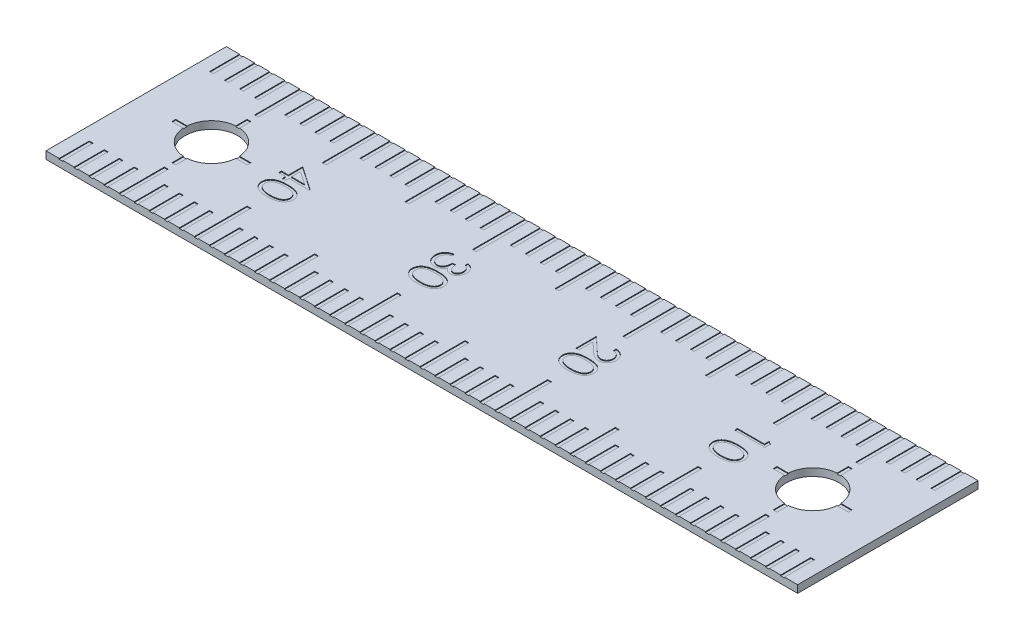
from build123d import *
from build123d.topology import SkipClean

# Parameters (mm, degrees)
BOSS_EXTRUDE1_DEPTH      = 0.5
SKETCH2_W                = 0.25
SKETCH2_H                = 2.0000000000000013
CUT_EXTRUDE2_DEPTH       = 0.05
LPATTERN2_COUNT          = 49
LPATTERN2_PITCH          = 1
SKETCH3_W                = 0.25
SKETCH3_H                = 1.4999999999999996
CUT_EXTRUDE3_DEPTH       = 0.05
LPATTERN3_COUNT          = 4
LPATTERN3_PITCH          = 10
SKETCH4_W                = 0.25
SKETCH4_H                = 0.9999999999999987
CUT_EXTRUDE4_DEPTH       = 0.05
LPATTERN4_COUNT          = 4
LPATTERN4_PITCH          = 10
LPATTERN4_COL_COUNT      = 2
LPATTERN4_COL_PITCH      = 10
CUT_EXTRUDE6_DEPTH       = 0.05
LPATTERN5_COUNT          = 2
LPATTERN5_PITCH          = 40
SKETCH20_R               = 1.750000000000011
CUT_EXTRUDE15_DEPTH      = 0.5
LPATTERN6_COUNT          = 2
LPATTERN6_PITCH          = 40
MIRROR1_COPY_1_SKETCH_W  = 0.25
MIRROR1_COPY_1_SKETCH_H  = 2.0000000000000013
MIRROR1_COPY_1_DEPTH     = 0.05
MIRROR1_COPY_2_SKETCH_W  = 0.25
MIRROR1_COPY_2_SKETCH_H  = 2.0000000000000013
MIRROR1_COPY_2_DEPTH     = 0.05
MIRROR1_COPY_3_SKETCH_W  = 0.25
MIRROR1_COPY_3_SKETCH_H  = 2.0000000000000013
MIRROR1_COPY_3_DEPTH     = 0.05
MIRROR1_COPY_4_SKETCH_W  = 0.25
MIRROR1_COPY_4_SKETCH_H  = 2.0000000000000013
MIRROR1_COPY_4_DEPTH     = 0.05
MIRROR1_COPY_5_SKETCH_W  = 0.25
MIRROR1_COPY_5_SKETCH_H  = 2.0000000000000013
MIRROR1_COPY_5_DEPTH     = 0.05
MIRROR1_COPY_6_SKETCH_W  = 0.25
MIRROR1_COPY_6_SKETCH_H  = 2.0000000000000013
MIRROR1_COPY_6_DEPTH     = 0.05
MIRROR1_COPY_7_SKETCH_W  = 0.25
MIRROR1_COPY_7_SKETCH_H  = 2.0000000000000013
MIRROR1_COPY_7_DEPTH     = 0.05
MIRROR1_COPY_8_SKETCH_W  = 0.25
MIRROR1_COPY_8_SKETCH_H  = 2.0000000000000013
MIRROR1_COPY_8_DEPTH     = 0.05
MIRROR1_COPY_9_SKETCH_W  = 0.25
MIRROR1_COPY_9_SKETCH_H  = 2.0000000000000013
MIRROR1_COPY_9_DEPTH     = 0.05
MIRROR1_COPY_10_SKETCH_W = 0.25
MIRROR1_COPY_10_SKETCH_H = 2.0000000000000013
MIRROR1_COPY_10_DEPTH    = 0.05
MIRROR1_COPY_11_SKETCH_W = 0.25
MIRROR1_COPY_11_SKETCH_H = 2.0000000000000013
MIRROR1_COPY_11_DEPTH    = 0.05
MIRROR1_COPY_12_SKETCH_W = 0.25
MIRROR1_COPY_12_SKETCH_H = 2.0000000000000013
MIRROR1_COPY_12_DEPTH    = 0.05
MIRROR1_COPY_13_SKETCH_W = 0.25
MIRROR1_COPY_13_SKETCH_H = 2.0000000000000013
MIRROR1_COPY_13_DEPTH    = 0.05
MIRROR1_COPY_14_SKETCH_W = 0.25
MIRROR1_COPY_14_SKETCH_H = 2.0000000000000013
MIRROR1_COPY_14_DEPTH    = 0.05
MIRROR1_COPY_15_SKETCH_W = 0.25
MIRROR1_COPY_15_SKETCH_H = 2.0000000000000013
MIRROR1_COPY_15_DEPTH    = 0.05
MIRROR1_COPY_16_SKETCH_W = 0.25
MIRROR1_COPY_16_SKETCH_H = 2.0000000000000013
MIRROR1_COPY_16_DEPTH    = 0.05
MIRROR1_COPY_17_SKETCH_W = 0.25
MIRROR1_COPY_17_SKETCH_H = 2.0000000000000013
MIRROR1_COPY_17_DEPTH    = 0.05
MIRROR1_COPY_18_SKETCH_W = 0.25
MIRROR1_COPY_18_SKETCH_H = 2.0000000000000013
MIRROR1_COPY_18_DEPTH    = 0.05
MIRROR1_COPY_19_SKETCH_W = 0.25
MIRROR1_COPY_19_SKETCH_H = 2.0000000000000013
MIRROR1_COPY_19_DEPTH    = 0.05
MIRROR1_COPY_20_SKETCH_W = 0.25
MIRROR1_COPY_20_SKETCH_H = 2.0000000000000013
MIRROR1_COPY_20_DEPTH    = 0.05
MIRROR1_COPY_21_SKETCH_W = 0.25
MIRROR1_COPY_21_SKETCH_H = 2.0000000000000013
MIRROR1_COPY_21_DEPTH    = 0.05
MIRROR1_COPY_22_SKETCH_W = 0.25
MIRROR1_COPY_22_SKETCH_H = 2.0000000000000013
MIRROR1_COPY_22_DEPTH    = 0.05
MIRROR1_COPY_23_SKETCH_W = 0.25
MIRROR1_COPY_23_SKETCH_H = 2.0000000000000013
MIRROR1_COPY_23_DEPTH    = 0.05
MIRROR1_COPY_24_SKETCH_W = 0.25
MIRROR1_COPY_24_SKETCH_H = 2.0000000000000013
MIRROR1_COPY_24_DEPTH    = 0.05
MIRROR1_COPY_25_SKETCH_W = 0.25
MIRROR1_COPY_25_SKETCH_H = 2.0000000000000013
MIRROR1_COPY_25_DEPTH    = 0.05
MIRROR1_COPY_26_SKETCH_W = 0.25
MIRROR1_COPY_26_SKETCH_H = 2.0000000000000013
MIRROR1_COPY_26_DEPTH    = 0.05
MIRROR1_COPY_27_SKETCH_W = 0.25
MIRROR1_COPY_27_SKETCH_H = 2.0000000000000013
MIRROR1_COPY_27_DEPTH    = 0.05
MIRROR1_COPY_28_SKETCH_W = 0.25
MIRROR1_COPY_28_SKETCH_H = 2.0000000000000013
MIRROR1_COPY_28_DEPTH    = 0.05
MIRROR1_COPY_29_SKETCH_W = 0.25
MIRROR1_COPY_29_SKETCH_H = 2.0000000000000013
MIRROR1_COPY_29_DEPTH    = 0.05
MIRROR1_COPY_30_SKETCH_W = 0.25
MIRROR1_COPY_30_SKETCH_H = 2.0000000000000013
MIRROR1_COPY_30_DEPTH    = 0.05
MIRROR1_COPY_31_SKETCH_W = 0.25
MIRROR1_COPY_31_SKETCH_H = 2.0000000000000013
MIRROR1_COPY_31_DEPTH    = 0.05
MIRROR1_COPY_32_SKETCH_W = 0.25
MIRROR1_COPY_32_SKETCH_H = 2.0000000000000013
MIRROR1_COPY_32_DEPTH    = 0.05
MIRROR1_COPY_33_SKETCH_W = 0.25
MIRROR1_COPY_33_SKETCH_H = 2.0000000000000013
MIRROR1_COPY_33_DEPTH    = 0.05
MIRROR1_COPY_34_SKETCH_W = 0.25
MIRROR1_COPY_34_SKETCH_H = 2.0000000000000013
MIRROR1_COPY_34_DEPTH    = 0.05
MIRROR1_COPY_35_SKETCH_W = 0.25
MIRROR1_COPY_35_SKETCH_H = 2.0000000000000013
MIRROR1_COPY_35_DEPTH    = 0.05
MIRROR1_COPY_36_SKETCH_W = 0.25
MIRROR1_COPY_36_SKETCH_H = 2.0000000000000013
MIRROR1_COPY_36_DEPTH    = 0.05
MIRROR1_COPY_37_SKETCH_W = 0.25
MIRROR1_COPY_37_SKETCH_H = 2.0000000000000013
MIRROR1_COPY_37_DEPTH    = 0.05
MIRROR1_COPY_38_SKETCH_W = 0.25
MIRROR1_COPY_38_SKETCH_H = 2.0000000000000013
MIRROR1_COPY_38_DEPTH    = 0.05
MIRROR1_COPY_39_SKETCH_W = 0.25
MIRROR1_COPY_39_SKETCH_H = 2.0000000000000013
MIRROR1_COPY_39_DEPTH    = 0.05
MIRROR1_COPY_40_SKETCH_W = 0.25
MIRROR1_COPY_40_SKETCH_H = 2.0000000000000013
MIRROR1_COPY_40_DEPTH    = 0.05
MIRROR1_COPY_41_SKETCH_W = 0.25
MIRROR1_COPY_41_SKETCH_H = 2.0000000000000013
MIRROR1_COPY_41_DEPTH    = 0.05
MIRROR1_COPY_42_SKETCH_W = 0.25
MIRROR1_COPY_42_SKETCH_H = 2.0000000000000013
MIRROR1_COPY_42_DEPTH    = 0.05
MIRROR1_COPY_43_SKETCH_W = 0.25
MIRROR1_COPY_43_SKETCH_H = 2.0000000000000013
MIRROR1_COPY_43_DEPTH    = 0.05
MIRROR1_COPY_44_SKETCH_W = 0.25
MIRROR1_COPY_44_SKETCH_H = 2.0000000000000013
MIRROR1_COPY_44_DEPTH    = 0.05
MIRROR1_COPY_45_SKETCH_W = 0.25
MIRROR1_COPY_45_SKETCH_H = 2.0000000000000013
MIRROR1_COPY_45_DEPTH    = 0.05
MIRROR1_COPY_46_SKETCH_W = 0.25
MIRROR1_COPY_46_SKETCH_H = 2.0000000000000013
MIRROR1_COPY_46_DEPTH    = 0.05
MIRROR1_COPY_47_SKETCH_W = 0.25
MIRROR1_COPY_47_SKETCH_H = 2.0000000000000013
MIRROR1_COPY_47_DEPTH    = 0.05
MIRROR1_COPY_48_SKETCH_W = 0.25
MIRROR1_COPY_48_SKETCH_H = 2.0000000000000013
MIRROR1_COPY_48_DEPTH    = 0.05
MIRROR1_COPY_49_SKETCH_W = 0.25
MIRROR1_COPY_49_SKETCH_H = 1.4999999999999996
MIRROR1_COPY_49_DEPTH    = 0.05
MIRROR1_COPY_50_SKETCH_W = 0.25
MIRROR1_COPY_50_SKETCH_H = 1.4999999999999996
MIRROR1_COPY_50_DEPTH    = 0.05
MIRROR1_COPY_51_SKETCH_W = 0.25
MIRROR1_COPY_51_SKETCH_H = 1.4999999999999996
MIRROR1_COPY_51_DEPTH    = 0.05
MIRROR1_COPY_52_SKETCH_W = 0.25
MIRROR1_COPY_52_SKETCH_H = 0.9999999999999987
MIRROR1_COPY_52_DEPTH    = 0.05
MIRROR1_COPY_53_SKETCH_W = 0.25
MIRROR1_COPY_53_SKETCH_H = 0.9999999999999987
MIRROR1_COPY_53_DEPTH    = 0.05
MIRROR1_COPY_54_SKETCH_W = 0.25
MIRROR1_COPY_54_SKETCH_H = 0.9999999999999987
MIRROR1_COPY_54_DEPTH    = 0.05
MIRROR1_COPY_55_SKETCH_W = 0.25
MIRROR1_COPY_55_SKETCH_H = 0.9999999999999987
MIRROR1_COPY_55_DEPTH    = 0.05
CUT_EXTRUDE18_DEPTH      = 0.05


with BuildPart() as part:
    # Sketch1 → Boss-Extrude1 (new body)
    with BuildSketch(Plane(origin=(0, 0, 0), x_dir=(1, 0, 0), z_dir=(0, 1, 0))):
        Polygon((-24.999999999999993, 6), (25, 6), (25.000000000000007, -6), (-24.999999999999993, -6), align=None)
    extrude(amount=-BOSS_EXTRUDE1_DEPTH)

    # Sketch2 → Cut-Extrude2 (cut)
    with BuildSketch(Plane(origin=(0, 0, 0), x_dir=(1, 0, 0), z_dir=(0, 1, 0))):
        with Locations((-23.999999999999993, 4.999999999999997)):
            Rectangle(SKETCH2_W, SKETCH2_H)
    cut_extrude2 = extrude(amount=-CUT_EXTRUDE2_DEPTH, mode=Mode.SUBTRACT)

    # LPattern2: Cut-Extrude2 ×49
    with Locations(*[(i * LPATTERN2_PITCH, 0, 0) for i in range(1, LPATTERN2_COUNT)]):
        add(cut_extrude2, mode=Mode.SUBTRACT)

    # Sketch3 → Cut-Extrude3 (cut)
    with BuildSketch(Plane(origin=(0, 0, 0), x_dir=(1, 0, 0), z_dir=(0, 1, 0))):
        with Locations((-14.999999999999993, 3.2499999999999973)):
            Rectangle(SKETCH3_W, SKETCH3_H)
    cut_extrude3 = extrude(amount=-CUT_EXTRUDE3_DEPTH, mode=Mode.SUBTRACT)

    # LPattern3: Cut-Extrude3 ×4
    with Locations(*[(i * LPATTERN3_PITCH, 0, 0) for i in range(1, LPATTERN3_COUNT)]):
        add(cut_extrude3, mode=Mode.SUBTRACT)

    # Sketch4 → Cut-Extrude4 (cut)
    with BuildSketch(Plane(origin=(0, 0, 0), x_dir=(1, 0, 0), z_dir=(0, 1, 0))):
        with Locations((-9.999999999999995, 3.4999999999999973)):
            Rectangle(SKETCH4_W, SKETCH4_H)
    cut_extrude4 = extrude(amount=-CUT_EXTRUDE4_DEPTH, mode=Mode.SUBTRACT)

    # LPattern4: Cut-Extrude4 ×4
    with Locations(*[(i * LPATTERN4_PITCH, 0, 0) for i in range(1, LPATTERN4_COUNT)]):
        add(cut_extrude4, mode=Mode.SUBTRACT)

    # LPattern4 col: Cut-Extrude4 ×2
    with Locations(*[(-i * LPATTERN4_COL_PITCH, 0, 0) for i in range(1, LPATTERN4_COL_COUNT)]):
        add(cut_extrude4, mode=Mode.SUBTRACT)

    # Sketch5 → Cut-Extrude6 (cut)
    with BuildSketch(Plane(origin=(0, 0, 0), x_dir=(1, 0, 0), z_dir=(0, 1, 0))):
        with BuildLine():
            Line((-20.119999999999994, 2.4999999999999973), (-19.869999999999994, 2.4999999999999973))
            Line((-19.869999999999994, 2.4999999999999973), (-19.86999999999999, 1.7455300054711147))
            ThreePointArc((-19.86999999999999, 1.7455300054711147), (-18.757563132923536, 1.2374368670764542), (-18.249469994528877, 0.1249999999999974))
            Line((-18.249469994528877, 0.1249999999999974), (-17.494999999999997, 0.1249999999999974))
            Line((-17.494999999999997, 0.1249999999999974), (-17.494999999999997, -0.1250000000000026))
            Line((-17.494999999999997, -0.1250000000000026), (-18.249469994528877, -0.12500000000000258))
            ThreePointArc((-18.249469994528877, -0.12500000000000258), (-18.757563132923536, -1.2374368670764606), (-19.869999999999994, -1.7455300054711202))
            Line((-19.869999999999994, -1.7455300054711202), (-19.86999999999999, -2.500000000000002))
            Line((-19.86999999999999, -2.500000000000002), (-20.119999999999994, -2.500000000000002))
            Line((-20.119999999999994, -2.500000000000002), (-20.119999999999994, -1.7455300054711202))
            ThreePointArc((-20.119999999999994, -1.7455300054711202), (-21.232436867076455, -1.2374368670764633), (-21.740530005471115, -0.12500000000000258))
            Line((-21.740530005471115, -0.12500000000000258), (-22.494999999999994, -0.1250000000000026))
            Line((-22.494999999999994, -0.1250000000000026), (-22.494999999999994, 0.1249999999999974))
            Line((-22.494999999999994, 0.1249999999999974), (-21.740530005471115, 0.1249999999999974))
            ThreePointArc((-21.740530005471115, 0.1249999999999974), (-21.23243686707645, 1.2374368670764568), (-20.11999999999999, 1.7455300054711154))
            Line((-20.11999999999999, 1.7455300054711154), (-20.119999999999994, 2.4999999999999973))
        make_face()
        with BuildLine():
            Line((-20.119999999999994, 1.4947825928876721), (-20.119999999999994, 0.1249999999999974))
            Line((-20.119999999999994, 0.1249999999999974), (-21.489782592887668, 0.1249999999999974))
            ThreePointArc((-21.489782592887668, 0.1249999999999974), (-21.055660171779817, 1.0606601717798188), (-20.119999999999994, 1.4947825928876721))
        make_face(mode=Mode.SUBTRACT)
        with BuildLine():
            Line((-19.869999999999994, 1.4947825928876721), (-19.869999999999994, 0.12499999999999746))
            Line((-19.869999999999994, 0.12499999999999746), (-18.500217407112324, 0.12499999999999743))
            ThreePointArc((-18.500217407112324, 0.12499999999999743), (-18.934339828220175, 1.0606601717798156), (-19.869999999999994, 1.4947825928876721))
        make_face(mode=Mode.SUBTRACT)
        with BuildLine():
            Line((-21.489782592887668, -0.1250000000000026), (-20.119999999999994, -0.1250000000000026))
            Line((-20.119999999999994, -0.1250000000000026), (-20.11999999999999, -1.4947825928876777))
            ThreePointArc((-20.11999999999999, -1.4947825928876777), (-21.055660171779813, -1.0606601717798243), (-21.489782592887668, -0.1250000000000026))
        make_face(mode=Mode.SUBTRACT)
        with BuildLine():
            Line((-19.869999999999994, -0.12500000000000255), (-19.86999999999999, -1.4947825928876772))
            ThreePointArc((-19.86999999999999, -1.4947825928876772), (-18.93433982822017, -1.0606601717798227), (-18.500217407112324, -0.12500000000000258))
            Line((-18.500217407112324, -0.12500000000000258), (-19.869999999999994, -0.12500000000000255))
        make_face(mode=Mode.SUBTRACT)
    cut_extrude6 = extrude(amount=-CUT_EXTRUDE6_DEPTH, mode=Mode.SUBTRACT)

    # LPattern5: Cut-Extrude6 ×2
    with Locations(*[(i * LPATTERN5_PITCH, 0, 0) for i in range(1, LPATTERN5_COUNT)]):
        add(cut_extrude6, mode=Mode.SUBTRACT)

    # Sketch20 → Cut-Extrude15 (cut)
    with SkipClean():  # the faces are left unmerged after this step: merging them gives an invalid solid
        with BuildSketch(Plane(origin=(0, 0, 0), x_dir=(1, 0, 0), z_dir=(0, 1, 0))):
            with Locations(Location((-19.994999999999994, -2.6e-15, 0), (0, 0, 270))):
                Circle(SKETCH20_R)
        cut_extrude15 = extrude(amount=-CUT_EXTRUDE15_DEPTH, mode=Mode.SUBTRACT)

    # LPattern6: Cut-Extrude15 ×2
    with Locations(*[(i * LPATTERN6_PITCH, 0, 0) for i in range(1, LPATTERN6_COUNT)]):
        add(cut_extrude15, mode=Mode.SUBTRACT)

    # Mirror1: Cut-Extrude2, Cut-Extrude3, Cut-Extrude4 across plane
    add(cut_extrude2.mirror(Plane.XY), mode=Mode.SUBTRACT)
    add(cut_extrude3.mirror(Plane.XY), mode=Mode.SUBTRACT)
    add(cut_extrude4.mirror(Plane.XY), mode=Mode.SUBTRACT)

    # Mirror1 copy 1 sketch → Mirror1 copy 1 (cut)
    with BuildSketch(Plane(origin=(1, 0, 0), x_dir=(1, 0, 0), z_dir=(0, 1, 0))):
        with Locations((-23.999999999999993, -4.999999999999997)):
            Rectangle(MIRROR1_COPY_1_SKETCH_W, MIRROR1_COPY_1_SKETCH_H)
    extrude(amount=-MIRROR1_COPY_1_DEPTH, mode=Mode.SUBTRACT)

    # Mirror1 copy 2 sketch → Mirror1 copy 2 (cut)
    with BuildSketch(Plane(origin=(2, 0, 0), x_dir=(1, 0, 0), z_dir=(0, 1, 0))):
        with Locations((-23.999999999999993, -4.999999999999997)):
            Rectangle(MIRROR1_COPY_2_SKETCH_W, MIRROR1_COPY_2_SKETCH_H)
    extrude(amount=-MIRROR1_COPY_2_DEPTH, mode=Mode.SUBTRACT)

    # Mirror1 copy 3 sketch → Mirror1 copy 3 (cut)
    with BuildSketch(Plane(origin=(3, 0, 0), x_dir=(1, 0, 0), z_dir=(0, 1, 0))):
        with Locations((-23.999999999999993, -4.999999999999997)):
            Rectangle(MIRROR1_COPY_3_SKETCH_W, MIRROR1_COPY_3_SKETCH_H)
    extrude(amount=-MIRROR1_COPY_3_DEPTH, mode=Mode.SUBTRACT)

    # Mirror1 copy 4 sketch → Mirror1 copy 4 (cut)
    with BuildSketch(Plane(origin=(4, 0, 0), x_dir=(1, 0, 0), z_dir=(0, 1, 0))):
        with Locations((-23.999999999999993, -4.999999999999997)):
            Rectangle(MIRROR1_COPY_4_SKETCH_W, MIRROR1_COPY_4_SKETCH_H)
    extrude(amount=-MIRROR1_COPY_4_DEPTH, mode=Mode.SUBTRACT)

    # Mirror1 copy 5 sketch → Mirror1 copy 5 (cut)
    with BuildSketch(Plane(origin=(5, 0, 0), x_dir=(1, 0, 0), z_dir=(0, 1, 0))):
        with Locations((-23.999999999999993, -4.999999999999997)):
            Rectangle(MIRROR1_COPY_5_SKETCH_W, MIRROR1_COPY_5_SKETCH_H)
    extrude(amount=-MIRROR1_COPY_5_DEPTH, mode=Mode.SUBTRACT)

    # Mirror1 copy 6 sketch → Mirror1 copy 6 (cut)
    with BuildSketch(Plane(origin=(6, 0, 0), x_dir=(1, 0, 0), z_dir=(0, 1, 0))):
        with Locations((-23.999999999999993, -4.999999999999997)):
            Rectangle(MIRROR1_COPY_6_SKETCH_W, MIRROR1_COPY_6_SKETCH_H)
    extrude(amount=-MIRROR1_COPY_6_DEPTH, mode=Mode.SUBTRACT)

    # Mirror1 copy 7 sketch → Mirror1 copy 7 (cut)
    with BuildSketch(Plane(origin=(7, 0, 0), x_dir=(1, 0, 0), z_dir=(0, 1, 0))):
        with Locations((-23.999999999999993, -4.999999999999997)):
            Rectangle(MIRROR1_COPY_7_SKETCH_W, MIRROR1_COPY_7_SKETCH_H)
    extrude(amount=-MIRROR1_COPY_7_DEPTH, mode=Mode.SUBTRACT)

    # Mirror1 copy 8 sketch → Mirror1 copy 8 (cut)
    with BuildSketch(Plane(origin=(8, 0, 0), x_dir=(1, 0, 0), z_dir=(0, 1, 0))):
        with Locations((-23.999999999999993, -4.999999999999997)):
            Rectangle(MIRROR1_COPY_8_SKETCH_W, MIRROR1_COPY_8_SKETCH_H)
    extrude(amount=-MIRROR1_COPY_8_DEPTH, mode=Mode.SUBTRACT)

    # Mirror1 copy 9 sketch → Mirror1 copy 9 (cut)
    with BuildSketch(Plane(origin=(9, 0, 0), x_dir=(1, 0, 0), z_dir=(0, 1, 0))):
        with Locations((-23.999999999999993, -4.999999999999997)):
            Rectangle(MIRROR1_COPY_9_SKETCH_W, MIRROR1_COPY_9_SKETCH_H)
    extrude(amount=-MIRROR1_COPY_9_DEPTH, mode=Mode.SUBTRACT)

    # Mirror1 copy 10 sketch → Mirror1 copy 10 (cut)
    with BuildSketch(Plane(origin=(10, 0, 0), x_dir=(1, 0, 0), z_dir=(0, 1, 0))):
        with Locations((-23.999999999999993, -4.999999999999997)):
            Rectangle(MIRROR1_COPY_10_SKETCH_W, MIRROR1_COPY_10_SKETCH_H)
    extrude(amount=-MIRROR1_COPY_10_DEPTH, mode=Mode.SUBTRACT)

    # Mirror1 copy 11 sketch → Mirror1 copy 11 (cut)
    with BuildSketch(Plane(origin=(11, 0, 0), x_dir=(1, 0, 0), z_dir=(0, 1, 0))):
        with Locations((-23.999999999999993, -4.999999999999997)):
            Rectangle(MIRROR1_COPY_11_SKETCH_W, MIRROR1_COPY_11_SKETCH_H)
    extrude(amount=-MIRROR1_COPY_11_DEPTH, mode=Mode.SUBTRACT)

    # Mirror1 copy 12 sketch → Mirror1 copy 12 (cut)
    with BuildSketch(Plane(origin=(12, 0, 0), x_dir=(1, 0, 0), z_dir=(0, 1, 0))):
        with Locations((-23.999999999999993, -4.999999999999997)):
            Rectangle(MIRROR1_COPY_12_SKETCH_W, MIRROR1_COPY_12_SKETCH_H)
    extrude(amount=-MIRROR1_COPY_12_DEPTH, mode=Mode.SUBTRACT)

    # Mirror1 copy 13 sketch → Mirror1 copy 13 (cut)
    with BuildSketch(Plane(origin=(13, 0, 0), x_dir=(1, 0, 0), z_dir=(0, 1, 0))):
        with Locations((-23.999999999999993, -4.999999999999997)):
            Rectangle(MIRROR1_COPY_13_SKETCH_W, MIRROR1_COPY_13_SKETCH_H)
    extrude(amount=-MIRROR1_COPY_13_DEPTH, mode=Mode.SUBTRACT)

    # Mirror1 copy 14 sketch → Mirror1 copy 14 (cut)
    with BuildSketch(Plane(origin=(14, 0, 0), x_dir=(1, 0, 0), z_dir=(0, 1, 0))):
        with Locations((-23.999999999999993, -4.999999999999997)):
            Rectangle(MIRROR1_COPY_14_SKETCH_W, MIRROR1_COPY_14_SKETCH_H)
    extrude(amount=-MIRROR1_COPY_14_DEPTH, mode=Mode.SUBTRACT)

    # Mirror1 copy 15 sketch → Mirror1 copy 15 (cut)
    with BuildSketch(Plane(origin=(15, 0, 0), x_dir=(1, 0, 0), z_dir=(0, 1, 0))):
        with Locations((-23.999999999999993, -4.999999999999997)):
            Rectangle(MIRROR1_COPY_15_SKETCH_W, MIRROR1_COPY_15_SKETCH_H)
    extrude(amount=-MIRROR1_COPY_15_DEPTH, mode=Mode.SUBTRACT)

    # Mirror1 copy 16 sketch → Mirror1 copy 16 (cut)
    with BuildSketch(Plane(origin=(16, 0, 0), x_dir=(1, 0, 0), z_dir=(0, 1, 0))):
        with Locations((-23.999999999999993, -4.999999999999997)):
            Rectangle(MIRROR1_COPY_16_SKETCH_W, MIRROR1_COPY_16_SKETCH_H)
    extrude(amount=-MIRROR1_COPY_16_DEPTH, mode=Mode.SUBTRACT)

    # Mirror1 copy 17 sketch → Mirror1 copy 17 (cut)
    with BuildSketch(Plane(origin=(17, 0, 0), x_dir=(1, 0, 0), z_dir=(0, 1, 0))):
        with Locations((-23.999999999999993, -4.999999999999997)):
            Rectangle(MIRROR1_COPY_17_SKETCH_W, MIRROR1_COPY_17_SKETCH_H)
    extrude(amount=-MIRROR1_COPY_17_DEPTH, mode=Mode.SUBTRACT)

    # Mirror1 copy 18 sketch → Mirror1 copy 18 (cut)
    with BuildSketch(Plane(origin=(18, 0, 0), x_dir=(1, 0, 0), z_dir=(0, 1, 0))):
        with Locations((-23.999999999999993, -4.999999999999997)):
            Rectangle(MIRROR1_COPY_18_SKETCH_W, MIRROR1_COPY_18_SKETCH_H)
    extrude(amount=-MIRROR1_COPY_18_DEPTH, mode=Mode.SUBTRACT)

    # Mirror1 copy 19 sketch → Mirror1 copy 19 (cut)
    with BuildSketch(Plane(origin=(19, 0, 0), x_dir=(1, 0, 0), z_dir=(0, 1, 0))):
        with Locations((-23.999999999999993, -4.999999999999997)):
            Rectangle(MIRROR1_COPY_19_SKETCH_W, MIRROR1_COPY_19_SKETCH_H)
    extrude(amount=-MIRROR1_COPY_19_DEPTH, mode=Mode.SUBTRACT)

    # Mirror1 copy 20 sketch → Mirror1 copy 20 (cut)
    with BuildSketch(Plane(origin=(20, 0, 0), x_dir=(1, 0, 0), z_dir=(0, 1, 0))):
        with Locations((-23.999999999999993, -4.999999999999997)):
            Rectangle(MIRROR1_COPY_20_SKETCH_W, MIRROR1_COPY_20_SKETCH_H)
    extrude(amount=-MIRROR1_COPY_20_DEPTH, mode=Mode.SUBTRACT)

    # Mirror1 copy 21 sketch → Mirror1 copy 21 (cut)
    with BuildSketch(Plane(origin=(21, 0, 0), x_dir=(1, 0, 0), z_dir=(0, 1, 0))):
        with Locations((-23.999999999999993, -4.999999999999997)):
            Rectangle(MIRROR1_COPY_21_SKETCH_W, MIRROR1_COPY_21_SKETCH_H)
    extrude(amount=-MIRROR1_COPY_21_DEPTH, mode=Mode.SUBTRACT)

    # Mirror1 copy 22 sketch → Mirror1 copy 22 (cut)
    with BuildSketch(Plane(origin=(22, 0, 0), x_dir=(1, 0, 0), z_dir=(0, 1, 0))):
        with Locations((-23.999999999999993, -4.999999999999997)):
            Rectangle(MIRROR1_COPY_22_SKETCH_W, MIRROR1_COPY_22_SKETCH_H)
    extrude(amount=-MIRROR1_COPY_22_DEPTH, mode=Mode.SUBTRACT)

    # Mirror1 copy 23 sketch → Mirror1 copy 23 (cut)
    with BuildSketch(Plane(origin=(23, 0, 0), x_dir=(1, 0, 0), z_dir=(0, 1, 0))):
        with Locations((-23.999999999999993, -4.999999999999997)):
            Rectangle(MIRROR1_COPY_23_SKETCH_W, MIRROR1_COPY_23_SKETCH_H)
    extrude(amount=-MIRROR1_COPY_23_DEPTH, mode=Mode.SUBTRACT)

    # Mirror1 copy 24 sketch → Mirror1 copy 24 (cut)
    with BuildSketch(Plane(origin=(24, 0, 0), x_dir=(1, 0, 0), z_dir=(0, 1, 0))):
        with Locations((-23.999999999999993, -4.999999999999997)):
            Rectangle(MIRROR1_COPY_24_SKETCH_W, MIRROR1_COPY_24_SKETCH_H)
    extrude(amount=-MIRROR1_COPY_24_DEPTH, mode=Mode.SUBTRACT)

    # Mirror1 copy 25 sketch → Mirror1 copy 25 (cut)
    with BuildSketch(Plane(origin=(25, 0, 0), x_dir=(1, 0, 0), z_dir=(0, 1, 0))):
        with Locations((-23.999999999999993, -4.999999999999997)):
            Rectangle(MIRROR1_COPY_25_SKETCH_W, MIRROR1_COPY_25_SKETCH_H)
    extrude(amount=-MIRROR1_COPY_25_DEPTH, mode=Mode.SUBTRACT)

    # Mirror1 copy 26 sketch → Mirror1 copy 26 (cut)
    with BuildSketch(Plane(origin=(26, 0, 0), x_dir=(1, 0, 0), z_dir=(0, 1, 0))):
        with Locations((-23.999999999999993, -4.999999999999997)):
            Rectangle(MIRROR1_COPY_26_SKETCH_W, MIRROR1_COPY_26_SKETCH_H)
    extrude(amount=-MIRROR1_COPY_26_DEPTH, mode=Mode.SUBTRACT)

    # Mirror1 copy 27 sketch → Mirror1 copy 27 (cut)
    with BuildSketch(Plane(origin=(27, 0, 0), x_dir=(1, 0, 0), z_dir=(0, 1, 0))):
        with Locations((-23.999999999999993, -4.999999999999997)):
            Rectangle(MIRROR1_COPY_27_SKETCH_W, MIRROR1_COPY_27_SKETCH_H)
    extrude(amount=-MIRROR1_COPY_27_DEPTH, mode=Mode.SUBTRACT)

    # Mirror1 copy 28 sketch → Mirror1 copy 28 (cut)
    with BuildSketch(Plane(origin=(28, 0, 0), x_dir=(1, 0, 0), z_dir=(0, 1, 0))):
        with Locations((-23.999999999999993, -4.999999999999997)):
            Rectangle(MIRROR1_COPY_28_SKETCH_W, MIRROR1_COPY_28_SKETCH_H)
    extrude(amount=-MIRROR1_COPY_28_DEPTH, mode=Mode.SUBTRACT)

    # Mirror1 copy 29 sketch → Mirror1 copy 29 (cut)
    with BuildSketch(Plane(origin=(29, 0, 0), x_dir=(1, 0, 0), z_dir=(0, 1, 0))):
        with Locations((-23.999999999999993, -4.999999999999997)):
            Rectangle(MIRROR1_COPY_29_SKETCH_W, MIRROR1_COPY_29_SKETCH_H)
    extrude(amount=-MIRROR1_COPY_29_DEPTH, mode=Mode.SUBTRACT)

    # Mirror1 copy 30 sketch → Mirror1 copy 30 (cut)
    with BuildSketch(Plane(origin=(30, 0, 0), x_dir=(1, 0, 0), z_dir=(0, 1, 0))):
        with Locations((-23.999999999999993, -4.999999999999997)):
            Rectangle(MIRROR1_COPY_30_SKETCH_W, MIRROR1_COPY_30_SKETCH_H)
    extrude(amount=-MIRROR1_COPY_30_DEPTH, mode=Mode.SUBTRACT)

    # Mirror1 copy 31 sketch → Mirror1 copy 31 (cut)
    with BuildSketch(Plane(origin=(31, 0, 0), x_dir=(1, 0, 0), z_dir=(0, 1, 0))):
        with Locations((-23.999999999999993, -4.999999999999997)):
            Rectangle(MIRROR1_COPY_31_SKETCH_W, MIRROR1_COPY_31_SKETCH_H)
    extrude(amount=-MIRROR1_COPY_31_DEPTH, mode=Mode.SUBTRACT)

    # Mirror1 copy 32 sketch → Mirror1 copy 32 (cut)
    with BuildSketch(Plane(origin=(32, 0, 0), x_dir=(1, 0, 0), z_dir=(0, 1, 0))):
        with Locations((-23.999999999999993, -4.999999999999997)):
            Rectangle(MIRROR1_COPY_32_SKETCH_W, MIRROR1_COPY_32_SKETCH_H)
    extrude(amount=-MIRROR1_COPY_32_DEPTH, mode=Mode.SUBTRACT)

    # Mirror1 copy 33 sketch → Mirror1 copy 33 (cut)
    with BuildSketch(Plane(origin=(33, 0, 0), x_dir=(1, 0, 0), z_dir=(0, 1, 0))):
        with Locations((-23.999999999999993, -4.999999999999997)):
            Rectangle(MIRROR1_COPY_33_SKETCH_W, MIRROR1_COPY_33_SKETCH_H)
    extrude(amount=-MIRROR1_COPY_33_DEPTH, mode=Mode.SUBTRACT)

    # Mirror1 copy 34 sketch → Mirror1 copy 34 (cut)
    with BuildSketch(Plane(origin=(34, 0, 0), x_dir=(1, 0, 0), z_dir=(0, 1, 0))):
        with Locations((-23.999999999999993, -4.999999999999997)):
            Rectangle(MIRROR1_COPY_34_SKETCH_W, MIRROR1_COPY_34_SKETCH_H)
    extrude(amount=-MIRROR1_COPY_34_DEPTH, mode=Mode.SUBTRACT)

    # Mirror1 copy 35 sketch → Mirror1 copy 35 (cut)
    with BuildSketch(Plane(origin=(35, 0, 0), x_dir=(1, 0, 0), z_dir=(0, 1, 0))):
        with Locations((-23.999999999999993, -4.999999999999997)):
            Rectangle(MIRROR1_COPY_35_SKETCH_W, MIRROR1_COPY_35_SKETCH_H)
    extrude(amount=-MIRROR1_COPY_35_DEPTH, mode=Mode.SUBTRACT)

    # Mirror1 copy 36 sketch → Mirror1 copy 36 (cut)
    with BuildSketch(Plane(origin=(36, 0, 0), x_dir=(1, 0, 0), z_dir=(0, 1, 0))):
        with Locations((-23.999999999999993, -4.999999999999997)):
            Rectangle(MIRROR1_COPY_36_SKETCH_W, MIRROR1_COPY_36_SKETCH_H)
    extrude(amount=-MIRROR1_COPY_36_DEPTH, mode=Mode.SUBTRACT)

    # Mirror1 copy 37 sketch → Mirror1 copy 37 (cut)
    with BuildSketch(Plane(origin=(37, 0, 0), x_dir=(1, 0, 0), z_dir=(0, 1, 0))):
        with Locations((-23.999999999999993, -4.999999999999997)):
            Rectangle(MIRROR1_COPY_37_SKETCH_W, MIRROR1_COPY_37_SKETCH_H)
    extrude(amount=-MIRROR1_COPY_37_DEPTH, mode=Mode.SUBTRACT)

    # Mirror1 copy 38 sketch → Mirror1 copy 38 (cut)
    with BuildSketch(Plane(origin=(38, 0, 0), x_dir=(1, 0, 0), z_dir=(0, 1, 0))):
        with Locations((-23.999999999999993, -4.999999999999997)):
            Rectangle(MIRROR1_COPY_38_SKETCH_W, MIRROR1_COPY_38_SKETCH_H)
    extrude(amount=-MIRROR1_COPY_38_DEPTH, mode=Mode.SUBTRACT)

    # Mirror1 copy 39 sketch → Mirror1 copy 39 (cut)
    with BuildSketch(Plane(origin=(39, 0, 0), x_dir=(1, 0, 0), z_dir=(0, 1, 0))):
        with Locations((-23.999999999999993, -4.999999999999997)):
            Rectangle(MIRROR1_COPY_39_SKETCH_W, MIRROR1_COPY_39_SKETCH_H)
    extrude(amount=-MIRROR1_COPY_39_DEPTH, mode=Mode.SUBTRACT)

    # Mirror1 copy 40 sketch → Mirror1 copy 40 (cut)
    with BuildSketch(Plane(origin=(40, 0, 0), x_dir=(1, 0, 0), z_dir=(0, 1, 0))):
        with Locations((-23.999999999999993, -4.999999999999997)):
            Rectangle(MIRROR1_COPY_40_SKETCH_W, MIRROR1_COPY_40_SKETCH_H)
    extrude(amount=-MIRROR1_COPY_40_DEPTH, mode=Mode.SUBTRACT)

    # Mirror1 copy 41 sketch → Mirror1 copy 41 (cut)
    with BuildSketch(Plane(origin=(41, 0, 0), x_dir=(1, 0, 0), z_dir=(0, 1, 0))):
        with Locations((-23.999999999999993, -4.999999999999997)):
            Rectangle(MIRROR1_COPY_41_SKETCH_W, MIRROR1_COPY_41_SKETCH_H)
    extrude(amount=-MIRROR1_COPY_41_DEPTH, mode=Mode.SUBTRACT)

    # Mirror1 copy 42 sketch → Mirror1 copy 42 (cut)
    with BuildSketch(Plane(origin=(42, 0, 0), x_dir=(1, 0, 0), z_dir=(0, 1, 0))):
        with Locations((-23.999999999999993, -4.999999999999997)):
            Rectangle(MIRROR1_COPY_42_SKETCH_W, MIRROR1_COPY_42_SKETCH_H)
    extrude(amount=-MIRROR1_COPY_42_DEPTH, mode=Mode.SUBTRACT)

    # Mirror1 copy 43 sketch → Mirror1 copy 43 (cut)
    with BuildSketch(Plane(origin=(43, 0, 0), x_dir=(1, 0, 0), z_dir=(0, 1, 0))):
        with Locations((-23.999999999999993, -4.999999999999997)):
            Rectangle(MIRROR1_COPY_43_SKETCH_W, MIRROR1_COPY_43_SKETCH_H)
    extrude(amount=-MIRROR1_COPY_43_DEPTH, mode=Mode.SUBTRACT)

    # Mirror1 copy 44 sketch → Mirror1 copy 44 (cut)
    with BuildSketch(Plane(origin=(44, 0, 0), x_dir=(1, 0, 0), z_dir=(0, 1, 0))):
        with Locations((-23.999999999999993, -4.999999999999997)):
            Rectangle(MIRROR1_COPY_44_SKETCH_W, MIRROR1_COPY_44_SKETCH_H)
    extrude(amount=-MIRROR1_COPY_44_DEPTH, mode=Mode.SUBTRACT)

    # Mirror1 copy 45 sketch → Mirror1 copy 45 (cut)
    with BuildSketch(Plane(origin=(45, 0, 0), x_dir=(1, 0, 0), z_dir=(0, 1, 0))):
        with Locations((-23.999999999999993, -4.999999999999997)):
            Rectangle(MIRROR1_COPY_45_SKETCH_W, MIRROR1_COPY_45_SKETCH_H)
    extrude(amount=-MIRROR1_COPY_45_DEPTH, mode=Mode.SUBTRACT)

    # Mirror1 copy 46 sketch → Mirror1 copy 46 (cut)
    with BuildSketch(Plane(origin=(46, 0, 0), x_dir=(1, 0, 0), z_dir=(0, 1, 0))):
        with Locations((-23.999999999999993, -4.999999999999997)):
            Rectangle(MIRROR1_COPY_46_SKETCH_W, MIRROR1_COPY_46_SKETCH_H)
    extrude(amount=-MIRROR1_COPY_46_DEPTH, mode=Mode.SUBTRACT)

    # Mirror1 copy 47 sketch → Mirror1 copy 47 (cut)
    with BuildSketch(Plane(origin=(47, 0, 0), x_dir=(1, 0, 0), z_dir=(0, 1, 0))):
        with Locations((-23.999999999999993, -4.999999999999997)):
            Rectangle(MIRROR1_COPY_47_SKETCH_W, MIRROR1_COPY_47_SKETCH_H)
    extrude(amount=-MIRROR1_COPY_47_DEPTH, mode=Mode.SUBTRACT)

    # Mirror1 copy 48 sketch → Mirror1 copy 48 (cut)
    with BuildSketch(Plane(origin=(48, 0, 0), x_dir=(1, 0, 0), z_dir=(0, 1, 0))):
        with Locations((-23.999999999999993, -4.999999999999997)):
            Rectangle(MIRROR1_COPY_48_SKETCH_W, MIRROR1_COPY_48_SKETCH_H)
    extrude(amount=-MIRROR1_COPY_48_DEPTH, mode=Mode.SUBTRACT)

    # Mirror1 copy 49 sketch → Mirror1 copy 49 (cut)
    with BuildSketch(Plane(origin=(10, 0, 0), x_dir=(1, 0, 0), z_dir=(0, 1, 0))):
        with Locations((-14.999999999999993, -3.2499999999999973)):
            Rectangle(MIRROR1_COPY_49_SKETCH_W, MIRROR1_COPY_49_SKETCH_H)
    extrude(amount=-MIRROR1_COPY_49_DEPTH, mode=Mode.SUBTRACT)

    # Mirror1 copy 50 sketch → Mirror1 copy 50 (cut)
    with BuildSketch(Plane(origin=(20, 0, 0), x_dir=(1, 0, 0), z_dir=(0, 1, 0))):
        with Locations((-14.999999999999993, -3.2499999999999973)):
            Rectangle(MIRROR1_COPY_50_SKETCH_W, MIRROR1_COPY_50_SKETCH_H)
    extrude(amount=-MIRROR1_COPY_50_DEPTH, mode=Mode.SUBTRACT)

    # Mirror1 copy 51 sketch → Mirror1 copy 51 (cut)
    with BuildSketch(Plane(origin=(30, 0, 0), x_dir=(1, 0, 0), z_dir=(0, 1, 0))):
        with Locations((-14.999999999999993, -3.2499999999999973)):
            Rectangle(MIRROR1_COPY_51_SKETCH_W, MIRROR1_COPY_51_SKETCH_H)
    extrude(amount=-MIRROR1_COPY_51_DEPTH, mode=Mode.SUBTRACT)

    # Mirror1 copy 52 sketch → Mirror1 copy 52 (cut)
    with BuildSketch(Plane(origin=(10, 0, 0), x_dir=(1, 0, 0), z_dir=(0, 1, 0))):
        with Locations((-9.999999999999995, -3.4999999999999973)):
            Rectangle(MIRROR1_COPY_52_SKETCH_W, MIRROR1_COPY_52_SKETCH_H)
    extrude(amount=-MIRROR1_COPY_52_DEPTH, mode=Mode.SUBTRACT)

    # Mirror1 copy 53 sketch → Mirror1 copy 53 (cut)
    with BuildSketch(Plane(origin=(20, 0, 0), x_dir=(1, 0, 0), z_dir=(0, 1, 0))):
        with Locations((-9.999999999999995, -3.4999999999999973)):
            Rectangle(MIRROR1_COPY_53_SKETCH_W, MIRROR1_COPY_53_SKETCH_H)
    extrude(amount=-MIRROR1_COPY_53_DEPTH, mode=Mode.SUBTRACT)

    # Mirror1 copy 54 sketch → Mirror1 copy 54 (cut)
    with BuildSketch(Plane(origin=(30, 0, 0), x_dir=(1, 0, 0), z_dir=(0, 1, 0))):
        with Locations((-9.999999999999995, -3.4999999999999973)):
            Rectangle(MIRROR1_COPY_54_SKETCH_W, MIRROR1_COPY_54_SKETCH_H)
    extrude(amount=-MIRROR1_COPY_54_DEPTH, mode=Mode.SUBTRACT)

    # Mirror1 copy 55 sketch → Mirror1 copy 55 (cut)
    with BuildSketch(Plane(origin=(-10, 0, 0), x_dir=(1, 0, 0), z_dir=(0, 1, 0))):
        with Locations((-9.999999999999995, -3.4999999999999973)):
            Rectangle(MIRROR1_COPY_55_SKETCH_W, MIRROR1_COPY_55_SKETCH_H)
    extrude(amount=-MIRROR1_COPY_55_DEPTH, mode=Mode.SUBTRACT)

    # Sketch26 → Cut-Extrude18 (cut)
    # profile 1 of 8: a face of its own
    with BuildSketch(Plane(origin=(0, 0, 0), x_dir=(1, 0, 0), z_dir=(0, 1, 0))):
        Polygon((16.000000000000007, 1.1903044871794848), (16.000000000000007, 0.8205128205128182), (14.000000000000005, 0.8205128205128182), (14.000000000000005, 0.9999999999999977), (15.794871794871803, 0.9999999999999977), (15.794871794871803, 1.3076923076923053), align=None)
    # profile 2 of 8: a face of its own
    with BuildSketch(Plane(origin=(0, 0, 0), x_dir=(1, 0, 0), z_dir=(0, 1, 0))):
        with BuildLine():
            add(Edge.make_bspline(
                [(14.999198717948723, 0.07692307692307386), (15.031254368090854, 0.07673563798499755), (15.09352293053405, 0.07637153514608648), (15.184257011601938, 0.07232100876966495), (15.269377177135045, 0.0655922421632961), (15.348887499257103, 0.05637088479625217), (15.422808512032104, 0.04514918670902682), (15.490942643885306, 0.03016889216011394), (15.553605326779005, 0.01313306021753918), (15.611000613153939, -0.00661138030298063), (15.663902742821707, -0.02888947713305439), (15.713286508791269, -0.05313988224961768), (15.759089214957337, -0.08031176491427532), (15.80199893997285, -0.10889859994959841), (15.841536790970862, -0.13994502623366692), (15.877627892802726, -0.1731235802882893), (15.910294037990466, -0.208763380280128), (15.939924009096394, -0.24615955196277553), (15.965735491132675, -0.2855484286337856), (15.988993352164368, -0.32571578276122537), (16.008082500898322, -0.3673703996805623), (16.023767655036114, -0.41013237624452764), (16.036335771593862, -0.45387735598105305), (16.045039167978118, -0.4987860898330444), (16.050493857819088, -0.5448694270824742), (16.051016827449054, -0.5759727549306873), (16.051282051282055, -0.591746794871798)],
                knots=[0, 0, 0, 0, 1.6463772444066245, 3.1981115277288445, 4.663803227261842, 6.031090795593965, 7.308794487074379, 8.502186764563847, 9.612154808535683, 10.642545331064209, 11.617106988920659, 12.55886617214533, 13.46588646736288, 14.350532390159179, 15.205425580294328, 16.045215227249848, 16.865619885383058, 17.6862252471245, 18.492864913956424, 19.282407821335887, 20.06809760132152, 20.842842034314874, 21.62016324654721, 22.403093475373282, 23.19012951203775, 24, 24, 24, 24], degree=3))
            add(Edge.make_bspline(
                [(16.051282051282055, -0.591746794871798), (16.051003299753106, -0.6076527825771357), (16.05044895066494, -0.6392847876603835), (16.04512098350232, -0.6860507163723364), (16.036280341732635, -0.7317362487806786), (16.023754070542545, -0.7761466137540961), (16.008213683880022, -0.8196466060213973), (15.988735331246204, -0.86189598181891), (15.966061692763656, -0.9031571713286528), (15.93941947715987, -0.942774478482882), (15.909715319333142, -0.9811828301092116), (15.876136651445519, -1.017438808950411), (15.839022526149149, -1.05154571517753), (15.79877003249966, -1.0839316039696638), (15.754607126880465, -1.113677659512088), (15.707301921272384, -1.1420053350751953), (15.656027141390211, -1.1673607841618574), (15.601638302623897, -1.1917805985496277), (15.542630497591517, -1.212858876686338), (15.479336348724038, -1.231868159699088), (15.411008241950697, -1.2472275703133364), (15.338004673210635, -1.260021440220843), (15.260057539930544, -1.26993280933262), (15.177333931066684, -1.2771514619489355), (15.089779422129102, -1.280964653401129), (15.029917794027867, -1.2816827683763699), (14.999198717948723, -1.2820512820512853)],
                knots=[0, 0, 0, 0, 0.8109147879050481, 1.6126543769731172, 2.3966978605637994, 3.1815986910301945, 3.9636281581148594, 4.749916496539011, 5.551656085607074, 6.361998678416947, 7.182127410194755, 8.025565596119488, 8.878627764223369, 9.75080545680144, 10.657531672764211, 11.591944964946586, 12.560506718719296, 13.57287815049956, 14.630710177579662, 15.753379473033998, 16.941251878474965, 18.199788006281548, 19.531962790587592, 20.947069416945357, 22.43333350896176, 23.999999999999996, 23.999999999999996, 23.999999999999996, 23.999999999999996], degree=3))
            add(Edge.make_bspline(
                [(14.999198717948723, -1.2820512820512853), (14.968613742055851, -1.2816784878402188), (14.909020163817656, -1.280952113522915), (14.821858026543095, -1.2771992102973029), (14.739578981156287, -1.2697719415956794), (14.66195399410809, -1.2605855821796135), (14.589443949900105, -1.2474997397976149), (14.521359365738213, -1.232623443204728), (14.458287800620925, -1.2141338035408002), (14.399591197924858, -1.193342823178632), (14.34546882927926, -1.1694528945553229), (14.29463729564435, -1.143873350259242), (14.247370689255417, -1.115719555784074), (14.20320842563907, -1.0857961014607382), (14.162606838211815, -1.0536854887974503), (14.125465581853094, -1.0194341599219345), (14.091809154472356, -0.9830160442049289), (14.0616991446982, -0.9445208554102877), (14.035367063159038, -0.9042803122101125), (14.011830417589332, -0.8631568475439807), (13.992731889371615, -0.8203296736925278), (13.976606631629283, -0.7767505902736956), (13.964051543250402, -0.732008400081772), (13.955455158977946, -0.6861469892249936), (13.949409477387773, -0.6393165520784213), (13.948949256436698, -0.6076582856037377), (13.948717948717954, -0.591746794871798)],
                knots=[0, 0, 0, 0, 1.5613064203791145, 3.042141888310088, 4.451772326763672, 5.777565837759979, 7.030558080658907, 8.211376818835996, 9.333164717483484, 10.38325378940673, 11.387583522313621, 12.350962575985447, 13.286244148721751, 14.193812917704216, 15.072134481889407, 15.925989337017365, 16.77021126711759, 17.60066989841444, 18.41744623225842, 19.223253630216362, 20.016477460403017, 20.807971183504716, 21.59360136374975, 22.38506573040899, 23.188331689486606, 24, 24, 24, 24], degree=3))
            add(Edge.make_bspline(
                [(13.948717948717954, -0.591746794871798), (13.948985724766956, -0.5759733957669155), (13.949513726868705, -0.5448713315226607), (13.954931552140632, -0.4987787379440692), (13.963766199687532, -0.45394004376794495), (13.975763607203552, -0.4102656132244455), (13.991011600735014, -0.3676660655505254), (14.01040648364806, -0.3265587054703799), (14.032901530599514, -0.28640064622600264), (14.058493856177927, -0.2473751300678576), (14.087821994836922, -0.2102259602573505), (14.120258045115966, -0.1747402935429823), (14.156615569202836, -0.1418141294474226), (14.196312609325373, -0.11115681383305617), (14.23901233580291, -0.08206468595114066), (14.28513537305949, -0.05515906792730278), (14.334981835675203, -0.03095596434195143), (14.388176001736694, -0.00817859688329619), (14.445993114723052, 0.01189960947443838), (14.50899001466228, 0.02950130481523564), (14.57751518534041, 0.04417478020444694), (14.651365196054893, 0.05597526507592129), (14.730595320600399, 0.06570357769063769), (14.815345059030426, 0.07228914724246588), (14.905541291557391, 0.0763747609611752), (14.967409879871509, 0.07673696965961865), (14.999198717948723, 0.07692307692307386)],
                knots=[0, 0, 0, 0, 0.8109408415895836, 1.5990170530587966, 2.3829820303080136, 3.1594797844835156, 3.9264413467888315, 4.706938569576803, 5.494146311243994, 6.292334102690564, 7.104379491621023, 7.925868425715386, 8.762126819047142, 9.623561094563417, 10.503686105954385, 11.417833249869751, 12.36699528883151, 13.351843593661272, 14.392337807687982, 15.512229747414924, 16.713911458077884, 17.994391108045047, 19.35747696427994, 20.818259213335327, 22.36518263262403, 24, 24, 24, 24], degree=3))
        make_face()
        with BuildLine():
            add(Edge.make_bspline(
                [(15.000000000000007, -0.10256410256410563), (14.973286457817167, -0.1026323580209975), (14.921440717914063, -0.10276482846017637), (14.84610171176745, -0.10622551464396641), (14.775832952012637, -0.11093993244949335), (14.710545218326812, -0.11702067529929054), (14.650459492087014, -0.12605092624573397), (14.595162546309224, -0.13616910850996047), (14.54494692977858, -0.14848224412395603), (14.499468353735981, -0.16305101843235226), (14.457954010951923, -0.179644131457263), (14.419326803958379, -0.19776406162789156), (14.383118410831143, -0.21721921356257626), (14.34969658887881, -0.23903050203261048), (14.318728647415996, -0.2627031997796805), (14.290303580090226, -0.28827617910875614), (14.26454541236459, -0.3157044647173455), (14.233980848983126, -0.35367420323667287), (14.20202284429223, -0.40355447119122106), (14.174536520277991, -0.46672409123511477), (14.157151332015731, -0.5316620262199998), (14.154946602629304, -0.5757504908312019), (14.153846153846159, -0.5977564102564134)],
                knots=[0, 0, 0, 0, 1.4591160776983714, 2.8318577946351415, 4.118796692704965, 5.3063717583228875, 6.412361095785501, 7.436813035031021, 8.37633938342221, 9.234574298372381, 10.04332389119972, 10.816788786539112, 11.564361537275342, 12.286735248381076, 12.994408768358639, 13.691741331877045, 14.372975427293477, 15.047457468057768, 16.35281191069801, 17.594285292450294, 18.79923321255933, 20, 20, 20, 20], degree=3))
            add(Edge.make_bspline(
                [(14.153846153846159, -0.5977564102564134), (14.15475917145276, -0.6199036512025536), (14.156583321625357, -0.6641524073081), (14.174182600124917, -0.7288002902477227), (14.200736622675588, -0.7915604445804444), (14.23213519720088, -0.8407444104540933), (14.262037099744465, -0.8781630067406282), (14.2875311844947, -0.9049727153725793), (14.316077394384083, -0.9295796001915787), (14.346876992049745, -0.9529179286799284), (14.380518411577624, -0.9743231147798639), (14.416839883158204, -0.9937877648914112), (14.4559422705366, -1.0115496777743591), (14.483239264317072, -1.0216691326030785), (14.497195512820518, -1.0268429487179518)],
                knots=[0, 0, 0, 0, 1.3537608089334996, 2.7047266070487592, 4.075137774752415, 5.516104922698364, 6.260822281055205, 7.007110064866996, 7.778089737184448, 8.566572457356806, 9.372053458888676, 10.217411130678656, 11.088608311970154, 12, 12, 12, 12], degree=3))
            add(Edge.make_bspline(
                [(14.497195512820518, -1.0268429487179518), (14.51504107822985, -1.0328725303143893), (14.551275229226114, -1.0451151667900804), (14.607483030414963, -1.0608933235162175), (14.6664560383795, -1.0733192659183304), (14.727841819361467, -1.0844983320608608), (14.792093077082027, -1.0921286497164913), (14.85901101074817, -1.098270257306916), (14.928646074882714, -1.1018877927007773), (14.975957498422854, -1.1023362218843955), (15.000000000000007, -1.1025641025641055)],
                knots=[0, 0, 0, 0, 0.8847067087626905, 1.7963340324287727, 2.7400279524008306, 3.714592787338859, 4.726048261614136, 5.777819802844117, 6.870742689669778, 8, 8, 8, 8], degree=3))
            add(Edge.make_bspline(
                [(15.000000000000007, -1.1025641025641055), (15.02404198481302, -1.1023127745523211), (15.071079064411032, -1.1018210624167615), (15.139894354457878, -1.0985904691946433), (15.205368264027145, -1.0933991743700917), (15.267560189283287, -1.086372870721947), (15.32635943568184, -1.076727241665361), (15.381850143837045, -1.065143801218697), (15.43401735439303, -1.0515635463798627), (15.482995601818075, -1.0359865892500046), (15.528608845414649, -1.0184315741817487), (15.570956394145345, -0.9990385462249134), (15.610262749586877, -0.978343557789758), (15.646415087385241, -0.9558614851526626), (15.679576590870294, -0.9318641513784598), (15.709082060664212, -0.9057169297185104), (15.735846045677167, -0.8784573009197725), (15.766396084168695, -0.840276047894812), (15.797545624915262, -0.7902907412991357), (15.826211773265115, -0.7280932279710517), (15.842673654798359, -0.6633671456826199), (15.844994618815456, -0.6196108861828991), (15.84615384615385, -0.5977564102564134)],
                knots=[0, 0, 0, 0, 1.3136686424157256, 2.570134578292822, 3.7633462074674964, 4.902004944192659, 5.988887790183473, 7.01788883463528, 7.99842539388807, 8.93305844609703, 9.824744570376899, 10.667209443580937, 11.476765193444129, 12.250262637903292, 12.991704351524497, 13.710426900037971, 14.401925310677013, 15.076585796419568, 16.37838513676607, 17.60978793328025, 18.806186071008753, 20, 20, 20, 20], degree=3))
            add(Edge.make_bspline(
                [(15.84615384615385, -0.5977564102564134), (15.844994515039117, -0.5756351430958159), (15.842673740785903, -0.5313523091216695), (15.826254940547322, -0.46596754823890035), (15.797812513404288, -0.4033269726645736), (15.766194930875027, -0.35374269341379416), (15.73638686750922, -0.31560961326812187), (15.71046566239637, -0.2886823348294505), (15.681954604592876, -0.26350813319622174), (15.651117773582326, -0.2398157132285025), (15.61767909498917, -0.21802542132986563), (15.581475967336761, -0.19856230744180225), (15.542845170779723, -0.18045277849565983), (15.501340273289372, -0.16382404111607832), (15.455793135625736, -0.14939028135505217), (15.405830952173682, -0.13648916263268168), (15.350482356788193, -0.1263771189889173), (15.290228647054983, -0.11755292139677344), (15.224860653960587, -0.11082497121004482), (15.154429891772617, -0.1062376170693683), (15.078960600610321, -0.10275856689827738), (15.026847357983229, -0.10263022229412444), (15.000000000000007, -0.10256410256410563)],
                knots=[0, 0, 0, 0, 1.207964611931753, 2.4181298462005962, 3.6557951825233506, 4.951004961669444, 5.620895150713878, 6.29679557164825, 6.9892241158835, 7.69685597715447, 8.41918716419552, 9.166715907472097, 9.940135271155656, 10.74883725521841, 11.60702164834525, 12.548275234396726, 13.565499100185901, 14.678641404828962, 15.874140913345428, 17.153726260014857, 18.533675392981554, 20, 20, 20, 20], degree=3))
        make_face(mode=Mode.SUBTRACT)
    # profile 3 of 8: a face of its own
    with BuildSketch(Plane(origin=(0, 0, 0), x_dir=(1, 0, 0), z_dir=(0, 1, 0))):
        with BuildLine():
            Line((5.384615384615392, 1.3589743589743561), (5.384615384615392, 1.5384615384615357))
            add(Edge.make_bspline(
                [(5.384615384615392, 1.5384615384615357), (5.408427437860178, 1.5372919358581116), (5.455193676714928, 1.5349948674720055), (5.523377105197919, 1.524233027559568), (5.588557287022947, 1.508848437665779), (5.650175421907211, 1.487044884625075), (5.70896759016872, 1.460119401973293), (5.764153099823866, 1.4271548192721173), (5.816279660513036, 1.3888538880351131), (5.864360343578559, 1.3452868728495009), (5.908312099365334, 1.298012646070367), (5.9466683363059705, 1.2473144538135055), (5.978704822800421, 1.1937133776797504), (6.005632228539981, 1.1376743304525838), (6.025819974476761, 1.0785492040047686), (6.040805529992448, 1.0169031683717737), (6.049820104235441, 0.9524575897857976), (6.050789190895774, 0.9085490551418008), (6.051282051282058, 0.8862179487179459)],
                knots=[0, 0, 0, 0, 1.1007762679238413, 2.161895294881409, 3.184016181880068, 4.190939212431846, 5.1765005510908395, 6.166955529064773, 7.155448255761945, 8.160289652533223, 9.160174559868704, 10.133824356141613, 11.091467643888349, 12.040886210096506, 13.000931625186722, 13.972173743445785, 14.968683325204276, 15.999999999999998, 15.999999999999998, 15.999999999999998, 15.999999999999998], degree=3))
            add(Edge.make_bspline(
                [(6.051282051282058, 0.8862179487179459), (6.050768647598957, 0.8642876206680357), (6.049759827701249, 0.821195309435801), (6.041096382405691, 0.7583027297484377), (6.027527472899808, 0.6984299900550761), (6.008490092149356, 0.6416941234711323), (5.982898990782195, 0.5885478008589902), (5.952157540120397, 0.5385917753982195), (5.9166033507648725, 0.49123131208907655), (5.874744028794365, 0.4485988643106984), (5.830056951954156, 0.4094513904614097), (5.7823495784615, 0.3756786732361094), (5.73307570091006, 0.34675686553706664), (5.681859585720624, 0.3226496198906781), (5.62821899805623, 0.30490325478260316), (5.572934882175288, 0.2914299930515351), (5.515434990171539, 0.2838143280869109), (5.476516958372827, 0.2826455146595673), (5.456730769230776, 0.2820512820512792)],
                knots=[0, 0, 0, 0, 1.1116073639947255, 2.184268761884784, 3.212621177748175, 4.221274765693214, 5.211760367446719, 6.196651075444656, 7.192147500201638, 8.207485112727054, 9.220403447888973, 10.201281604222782, 11.16644169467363, 12.114753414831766, 13.065576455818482, 14.02645073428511, 14.996634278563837, 16, 16, 16, 16], degree=3))
            add(Edge.make_bspline(
                [(5.456730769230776, 0.2820512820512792), (5.428874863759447, 0.28301886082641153), (5.373651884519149, 0.28493703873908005), (5.292500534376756, 0.3013452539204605), (5.2138757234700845, 0.32697183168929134), (5.150597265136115, 0.35782746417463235), (5.099606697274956, 0.3889545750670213), (5.057624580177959, 0.4170045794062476), (5.012421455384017, 0.44984161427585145), (4.96414869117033, 0.4879436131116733), (4.912428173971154, 0.5305223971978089), (4.857291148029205, 0.5779636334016), (4.799307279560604, 0.6306056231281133), (4.759704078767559, 0.6675533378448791), (4.7391826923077, 0.6866987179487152)],
                knots=[0, 0, 0, 0, 1.1844263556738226, 2.348067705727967, 3.5090691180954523, 4.6961105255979, 5.333549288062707, 6.050745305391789, 6.844228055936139, 7.710549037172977, 8.667450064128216, 9.695053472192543, 10.805634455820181, 12, 12, 12, 12], degree=3))
            Line((4.7391826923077, 0.6866987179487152), (4.205128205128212, 1.1870993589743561))
            Line((4.205128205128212, 1.1870993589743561), (4.205128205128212, 0.2564102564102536))
            Line((4.205128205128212, 0.2564102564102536), (4.000000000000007, 0.2564102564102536))
            Line((4.000000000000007, 0.2564102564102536), (4.000000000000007, 1.6153846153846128))
            Line((4.000000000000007, 1.6153846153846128), (4.827724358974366, 0.839743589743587))
            add(Edge.make_bspline(
                [(4.827724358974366, 0.839743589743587), (4.8474366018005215, 0.8208577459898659), (4.885299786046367, 0.784581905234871), (4.9405956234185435, 0.7332951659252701), (4.99183410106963, 0.687157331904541), (5.039242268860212, 0.6461377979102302), (5.082551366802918, 0.6102028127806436), (5.122100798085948, 0.5794673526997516), (5.157551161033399, 0.5537955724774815), (5.199196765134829, 0.5265888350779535), (5.250103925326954, 0.5006454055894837), (5.312002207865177, 0.47784378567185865), (5.375862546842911, 0.46403999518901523), (5.4190044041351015, 0.46237564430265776), (5.440705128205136, 0.4615384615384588)],
                knots=[0, 0, 0, 0, 1.3295300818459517, 2.5537551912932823, 3.672934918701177, 4.687409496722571, 5.606792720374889, 6.413407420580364, 7.126401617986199, 7.737995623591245, 8.834647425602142, 9.900448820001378, 10.943907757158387, 12, 12, 12, 12], degree=3))
            add(Edge.make_bspline(
                [(5.440705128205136, 0.4615384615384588), (5.454353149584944, 0.46189801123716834), (5.4812507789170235, 0.4626066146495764), (5.520661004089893, 0.468978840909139), (5.558824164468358, 0.4783409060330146), (5.595268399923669, 0.4927707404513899), (5.630710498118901, 0.5101076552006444), (5.664072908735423, 0.5322568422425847), (5.696492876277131, 0.5575675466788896), (5.726858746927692, 0.586926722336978), (5.754678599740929, 0.6191576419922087), (5.779320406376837, 0.6532126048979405), (5.799914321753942, 0.6892409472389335), (5.816796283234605, 0.727092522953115), (5.830039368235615, 0.7666613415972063), (5.839215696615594, 0.808024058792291), (5.844977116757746, 0.8510663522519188), (5.845756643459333, 0.8804569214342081), (5.846153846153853, 0.8954326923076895)],
                knots=[0, 0, 0, 0, 0.9915046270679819, 1.9540652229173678, 2.8959859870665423, 3.8425986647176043, 4.797835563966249, 5.759220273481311, 6.747868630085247, 7.784730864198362, 8.824135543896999, 9.839918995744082, 10.835834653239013, 11.835434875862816, 12.848616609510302, 13.863796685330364, 14.911511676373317, 16, 16, 16, 16], degree=3))
            add(Edge.make_bspline(
                [(5.846153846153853, 0.8954326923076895), (5.845745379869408, 0.9110732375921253), (5.844943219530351, 0.9417886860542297), (5.839328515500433, 0.986884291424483), (5.8296515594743, 1.0299083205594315), (5.816384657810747, 1.0709478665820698), (5.799681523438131, 1.1100424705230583), (5.778475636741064, 1.1468386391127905), (5.753594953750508, 1.1816723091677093), (5.725232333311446, 1.2144795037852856), (5.6935053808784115, 1.244624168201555), (5.658573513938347, 1.2716663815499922), (5.620209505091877, 1.29473053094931), (5.579279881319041, 1.3151758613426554), (5.53469637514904, 1.33081956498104), (5.487539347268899, 1.3441916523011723), (5.437138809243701, 1.3539054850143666), (5.4024139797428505, 1.357256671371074), (5.384615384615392, 1.3589743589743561)],
                knots=[0, 0, 0, 0, 1.031212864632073, 2.0251317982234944, 2.99075744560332, 3.9347812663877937, 4.865570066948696, 5.788494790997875, 6.729227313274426, 7.6843567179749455, 8.6435771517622, 9.610526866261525, 10.590658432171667, 11.590954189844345, 12.62164056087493, 13.700587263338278, 14.821410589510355, 16, 16, 16, 16], degree=3))
        make_face()
    # profile 4 of 8: a face of its own
    with BuildSketch(Plane(origin=(0, 0, 0), x_dir=(1, 0, 0), z_dir=(0, 1, 0))):
        with BuildLine():
            add(Edge.make_bspline(
                [(4.999198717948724, 0.0769230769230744), (5.031254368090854, 0.0767356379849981), (5.093522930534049, 0.07637153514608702), (5.184257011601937, 0.07232100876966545), (5.269377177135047, 0.06559224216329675), (5.348887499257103, 0.05637088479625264), (5.4228085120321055, 0.04514918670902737), (5.490942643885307, 0.0301688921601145), (5.5536053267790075, 0.01313306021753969), (5.611000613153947, -0.00661138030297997), (5.6639027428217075, -0.02888947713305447), (5.713286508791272, -0.05313988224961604), (5.75908921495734, -0.08031176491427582), (5.801998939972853, -0.10889859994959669), (5.841536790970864, -0.13994502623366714), (5.8776278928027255, -0.17312358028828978), (5.91029403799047, -0.20876338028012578), (5.939924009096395, -0.24615955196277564), (5.965735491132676, -0.2855484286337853), (5.98899335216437, -0.3257157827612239), (6.008082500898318, -0.3673703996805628), (6.023767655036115, -0.41013237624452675), (6.036335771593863, -0.4538773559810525), (6.045039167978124, -0.49878608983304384), (6.050493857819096, -0.5448694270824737), (6.051016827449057, -0.5759727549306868), (6.051282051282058, -0.5917467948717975)],
                knots=[0, 0, 0, 0, 1.6463772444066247, 3.198111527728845, 4.663803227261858, 6.0310907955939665, 7.3087944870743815, 8.50218676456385, 9.612154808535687, 10.642545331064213, 11.617106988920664, 12.558866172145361, 13.465886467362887, 14.350532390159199, 15.205425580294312, 16.04521522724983, 16.86561988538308, 17.686225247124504, 18.492864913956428, 19.282407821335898, 20.06809760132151, 20.842842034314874, 21.620163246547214, 22.403093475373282, 23.19012951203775, 24, 24, 24, 24], degree=3))
            add(Edge.make_bspline(
                [(6.051282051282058, -0.5917467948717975), (6.051003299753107, -0.6076527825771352), (6.050448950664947, -0.639284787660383), (6.045120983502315, -0.6860507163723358), (6.036280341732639, -0.731736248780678), (6.023754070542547, -0.7761466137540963), (6.008213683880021, -0.8196466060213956), (5.9887353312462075, -0.8618959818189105), (5.966061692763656, -0.9031571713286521), (5.93941947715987, -0.942774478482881), (5.909715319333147, -0.9811828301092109), (5.876136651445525, -1.0174388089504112), (5.83902252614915, -1.051545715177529), (5.798770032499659, -1.083931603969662), (5.754607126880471, -1.1136776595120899), (5.707301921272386, -1.1420053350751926), (5.656027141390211, -1.1673607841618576), (5.601638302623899, -1.191780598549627), (5.542630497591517, -1.2128588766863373), (5.479336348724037, -1.2318681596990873), (5.411008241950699, -1.2472275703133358), (5.338004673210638, -1.2600214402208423), (5.260057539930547, -1.2699328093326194), (5.177333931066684, -1.2771514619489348), (5.089779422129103, -1.2809646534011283), (5.029917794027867, -1.2816827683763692), (4.999198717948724, -1.2820512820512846)],
                knots=[0, 0, 0, 0, 0.8109147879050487, 1.6126543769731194, 2.396697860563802, 3.181598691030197, 3.9636281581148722, 4.749916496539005, 5.551656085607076, 6.361998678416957, 7.182127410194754, 8.025565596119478, 8.87862776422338, 9.750805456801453, 10.657531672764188, 11.591944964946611, 12.560506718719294, 13.572878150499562, 14.630710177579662, 15.753379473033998, 16.941251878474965, 18.199788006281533, 19.531962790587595, 20.947069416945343, 22.433333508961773, 24, 24, 24, 24], degree=3))
            add(Edge.make_bspline(
                [(4.999198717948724, -1.2820512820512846), (4.968613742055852, -1.281678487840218), (4.909020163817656, -1.2809521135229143), (4.8218580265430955, -1.2771992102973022), (4.739578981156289, -1.2697719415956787), (4.661953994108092, -1.2605855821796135), (4.589443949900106, -1.247499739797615), (4.521359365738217, -1.2326234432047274), (4.458287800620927, -1.2141338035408), (4.399591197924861, -1.193342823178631), (4.345468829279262, -1.1694528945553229), (4.294637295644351, -1.143873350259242), (4.24737068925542, -1.1157195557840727), (4.203208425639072, -1.0857961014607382), (4.1626068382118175, -1.0536854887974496), (4.1254655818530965, -1.0194341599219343), (4.091809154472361, -0.9830160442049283), (4.061699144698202, -0.9445208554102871), (4.035367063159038, -0.9042803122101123), (4.011830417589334, -0.86315684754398), (3.992731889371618, -0.8203296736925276), (3.976606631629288, -0.7767505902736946), (3.964051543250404, -0.7320084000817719), (3.9554551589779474, -0.6861469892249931), (3.9494094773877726, -0.6393165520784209), (3.9489492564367, -0.6076582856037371), (3.948717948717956, -0.5917467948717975)],
                knots=[0, 0, 0, 0, 1.56130642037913, 3.0421418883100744, 4.451772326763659, 5.7775658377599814, 7.03055808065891, 8.211376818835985, 9.33316471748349, 10.383253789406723, 11.387583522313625, 12.350962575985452, 13.286244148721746, 14.193812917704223, 15.072134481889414, 15.925989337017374, 16.77021126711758, 17.600669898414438, 18.417446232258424, 19.223253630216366, 20.01647746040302, 20.807971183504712, 21.59360136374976, 22.385065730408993, 23.188331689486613, 24.000000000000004, 24.000000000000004, 24.000000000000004, 24.000000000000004], degree=3))
            add(Edge.make_bspline(
                [(3.948717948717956, -0.5917467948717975), (3.948985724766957, -0.5759733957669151), (3.949513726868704, -0.5448713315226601), (3.954931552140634, -0.4987787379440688), (3.963766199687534, -0.4539400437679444), (3.9757636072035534, -0.4102656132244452), (3.9910116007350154, -0.36766606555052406), (4.0104064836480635, -0.32655870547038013), (4.032901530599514, -0.28640064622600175), (4.058493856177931, -0.2473751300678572), (4.087821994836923, -0.2102259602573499), (4.1202580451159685, -0.1747402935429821), (4.156615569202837, -0.14181412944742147), (4.196312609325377, -0.11115681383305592), (4.2390123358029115, -0.08206468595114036), (4.285135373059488, -0.05515906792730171), (4.334981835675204, -0.03095596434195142), (4.388176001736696, -0.00817859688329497), (4.445993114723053, 0.01189960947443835), (4.508990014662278, 0.02950130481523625), (4.577515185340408, 0.04417478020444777), (4.651365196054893, 0.05597526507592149), (4.7305953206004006, 0.06570357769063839), (4.8153450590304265, 0.07228914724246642), (4.905541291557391, 0.07637476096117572), (4.96740987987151, 0.0767369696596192), (4.999198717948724, 0.0769230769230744)],
                knots=[0, 0, 0, 0, 0.8109408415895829, 1.5990170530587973, 2.3829820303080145, 3.1594797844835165, 3.926441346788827, 4.706938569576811, 5.494146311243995, 6.292334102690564, 7.104379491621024, 7.925868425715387, 8.76212681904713, 9.623561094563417, 10.503686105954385, 11.417833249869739, 12.36699528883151, 13.351843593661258, 14.392337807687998, 15.512229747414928, 16.71391145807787, 17.99439110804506, 19.357476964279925, 20.818259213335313, 22.36518263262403, 23.999999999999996, 23.999999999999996, 23.999999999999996, 23.999999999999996], degree=3))
        make_face()
        with BuildLine():
            add(Edge.make_bspline(
                [(5.000000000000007, -0.10256410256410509), (4.973286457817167, -0.10263235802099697), (4.921440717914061, -0.10276482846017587), (4.846101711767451, -0.10622551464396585), (4.775832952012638, -0.11093993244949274), (4.710545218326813, -0.11702067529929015), (4.650459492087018, -0.12605092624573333), (4.595162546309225, -0.13616910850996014), (4.544946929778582, -0.14848224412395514), (4.499468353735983, -0.16305101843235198), (4.457954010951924, -0.17964413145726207), (4.41932680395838, -0.19776406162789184), (4.3831184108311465, -0.2172192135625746), (4.349696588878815, -0.23903050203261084), (4.318728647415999, -0.2627031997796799), (4.290303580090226, -0.2882761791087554), (4.264545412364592, -0.3157044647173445), (4.23398084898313, -0.3536742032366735), (4.20202284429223, -0.40355447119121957), (4.174536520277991, -0.4667240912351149), (4.157151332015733, -0.5316620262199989), (4.154946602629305, -0.5757504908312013), (4.15384615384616, -0.5977564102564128)],
                knots=[0, 0, 0, 0, 1.4591160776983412, 2.8318577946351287, 4.1187966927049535, 5.306371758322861, 6.412361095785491, 7.436813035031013, 8.376339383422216, 9.234574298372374, 10.043323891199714, 10.816788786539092, 11.564361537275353, 12.286735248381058, 12.994408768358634, 13.691741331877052, 14.372975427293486, 15.047457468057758, 16.35281191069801, 17.59428529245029, 18.799233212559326, 20, 20, 20, 20], degree=3))
            add(Edge.make_bspline(
                [(4.15384615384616, -0.5977564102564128), (4.154759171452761, -0.619903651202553), (4.1565833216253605, -0.6641524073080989), (4.174182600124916, -0.7288002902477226), (4.20073662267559, -0.7915604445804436), (4.232135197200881, -0.8407444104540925), (4.262037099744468, -0.8781630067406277), (4.287531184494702, -0.9049727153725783), (4.316077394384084, -0.9295796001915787), (4.346876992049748, -0.9529179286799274), (4.380518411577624, -0.9743231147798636), (4.416839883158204, -0.9937877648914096), (4.455942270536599, -1.0115496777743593), (4.483239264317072, -1.021669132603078), (4.497195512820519, -1.0268429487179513)],
                knots=[0, 0, 0, 0, 1.3537608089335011, 2.704726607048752, 4.075137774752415, 5.516104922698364, 6.260822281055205, 7.007110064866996, 7.778089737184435, 8.566572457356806, 9.372053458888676, 10.217411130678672, 11.08860831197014, 12, 12, 12, 12], degree=3))
            add(Edge.make_bspline(
                [(4.497195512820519, -1.0268429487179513), (4.51504107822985, -1.0328725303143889), (4.551275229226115, -1.0451151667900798), (4.6074830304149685, -1.0608933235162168), (4.6664560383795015, -1.0733192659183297), (4.727841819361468, -1.0844983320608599), (4.792093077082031, -1.092128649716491), (4.859011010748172, -1.0982702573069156), (4.928646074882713, -1.1018877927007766), (4.975957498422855, -1.102336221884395), (5.000000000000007, -1.102564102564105)],
                knots=[0, 0, 0, 0, 0.8847067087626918, 1.796334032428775, 2.7400279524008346, 3.7145927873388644, 4.72604826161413, 5.777819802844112, 6.87074268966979, 8, 8, 8, 8], degree=3))
            add(Edge.make_bspline(
                [(5.000000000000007, -1.102564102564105), (5.024041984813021, -1.1023127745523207), (5.07107906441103, -1.1018210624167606), (5.139894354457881, -1.098590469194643), (5.205368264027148, -1.093399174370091), (5.267560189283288, -1.0863728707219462), (5.326359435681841, -1.076727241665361), (5.381850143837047, -1.0651438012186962), (5.43401735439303, -1.0515635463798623), (5.482995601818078, -1.0359865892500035), (5.528608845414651, -1.0184315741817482), (5.570956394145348, -0.9990385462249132), (5.61026274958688, -0.9783435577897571), (5.646415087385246, -0.9558614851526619), (5.679576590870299, -0.9318641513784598), (5.709082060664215, -0.9057169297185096), (5.735846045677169, -0.8784573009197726), (5.766396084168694, -0.8402760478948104), (5.797545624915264, -0.7902907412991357), (5.82621177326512, -0.7280932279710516), (5.842673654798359, -0.6633671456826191), (5.844994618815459, -0.6196108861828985), (5.846153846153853, -0.5977564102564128)],
                knots=[0, 0, 0, 0, 1.3136686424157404, 2.5701345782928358, 3.7633462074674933, 4.9020049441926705, 5.988887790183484, 7.017888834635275, 7.998425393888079, 8.933058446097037, 9.824744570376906, 10.667209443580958, 11.476765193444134, 12.250262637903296, 12.991704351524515, 13.710426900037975, 14.401925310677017, 15.076585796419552, 16.378385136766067, 17.609787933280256, 18.806186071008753, 20, 20, 20, 20], degree=3))
            add(Edge.make_bspline(
                [(5.846153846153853, -0.5977564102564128), (5.84499451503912, -0.5756351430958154), (5.842673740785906, -0.5313523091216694), (5.826254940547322, -0.46596754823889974), (5.797812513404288, -0.40332697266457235), (5.7661949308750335, -0.3537426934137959), (5.736386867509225, -0.3156096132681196), (5.710465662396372, -0.28868233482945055), (5.681954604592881, -0.26350813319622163), (5.651117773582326, -0.23981571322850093), (5.617679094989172, -0.21802542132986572), (5.581475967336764, -0.19856230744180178), (5.542845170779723, -0.1804527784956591), (5.501340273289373, -0.1638240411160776), (5.455793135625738, -0.1493902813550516), (5.405830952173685, -0.13648916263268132), (5.350482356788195, -0.12637711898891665), (5.290228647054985, -0.11755292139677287), (5.224860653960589, -0.11082497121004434), (5.154429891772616, -0.1062376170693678), (5.078960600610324, -0.10275856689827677), (5.026847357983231, -0.10263022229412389), (5.000000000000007, -0.10256410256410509)],
                knots=[0, 0, 0, 0, 1.2079646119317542, 2.418129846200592, 3.6557951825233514, 4.95100496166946, 5.620895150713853, 6.296795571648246, 6.989224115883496, 7.696855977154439, 8.419187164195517, 9.166715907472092, 9.940135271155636, 10.74883725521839, 11.607021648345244, 12.548275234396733, 13.56549910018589, 14.67864140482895, 15.874140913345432, 17.15372626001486, 18.533675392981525, 20, 20, 20, 20], degree=3))
        make_face(mode=Mode.SUBTRACT)
    # profile 5 of 8: a face of its own
    with BuildSketch(Plane(origin=(0, 0, 0), x_dir=(1, 0, 0), z_dir=(0, 1, 0))):
        with BuildLine():
            Line((-4.461538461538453, 1.3589743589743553), (-4.461538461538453, 1.5384615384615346))
            add(Edge.make_bspline(
                [(-4.461538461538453, 1.5384615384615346), (-4.441405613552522, 1.5335989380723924), (-4.402047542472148, 1.5240929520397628), (-4.3458148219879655, 1.5042657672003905), (-4.292601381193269, 1.4826661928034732), (-4.243403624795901, 1.4567295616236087), (-4.1972328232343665, 1.4284388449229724), (-4.155136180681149, 1.3960258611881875), (-4.116043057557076, 1.3609860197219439), (-4.081349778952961, 1.3222289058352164), (-4.049933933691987, 1.2815839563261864), (-4.0231481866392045, 1.2384784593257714), (-4.000105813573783, 1.193779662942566), (-3.981122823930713, 1.1471778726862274), (-3.9668225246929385, 1.0985343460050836), (-3.9564472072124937, 1.0482888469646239), (-3.9497094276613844, 0.9963097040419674), (-3.949051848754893, 0.9610253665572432), (-3.94871794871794, 0.9431089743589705)],
                knots=[0, 0, 0, 0, 1.1620055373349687, 2.271625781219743, 3.3437588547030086, 4.383309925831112, 5.3902295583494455, 6.379919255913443, 7.36185416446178, 8.333198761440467, 9.295911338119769, 10.242430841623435, 11.17795921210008, 12.116337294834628, 13.062827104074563, 14.02006477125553, 14.994644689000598, 15.999999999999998, 15.999999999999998, 15.999999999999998, 15.999999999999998], degree=3))
            add(Edge.make_bspline(
                [(-3.94871794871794, 0.9431089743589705), (-3.949506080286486, 0.9170045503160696), (-3.9510651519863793, 0.8653651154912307), (-3.9653019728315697, 0.7895005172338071), (-3.9878306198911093, 0.7163423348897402), (-4.0189584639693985, 0.6466913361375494), (-4.057351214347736, 0.5819950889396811), (-4.103045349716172, 0.5244315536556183), (-4.155159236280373, 0.47478097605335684), (-4.212720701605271, 0.43312704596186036), (-4.274238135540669, 0.400512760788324), (-4.337552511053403, 0.37646340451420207), (-4.402513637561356, 0.36182244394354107), (-4.446374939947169, 0.35992498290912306), (-4.468349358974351, 0.358974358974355)],
                knots=[0, 0, 0, 0, 1.0830509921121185, 2.1424774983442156, 3.193116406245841, 4.255571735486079, 5.302633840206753, 6.308962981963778, 7.297363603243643, 8.282367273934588, 9.249857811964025, 10.179914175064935, 11.08814088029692, 12, 12, 12, 12], degree=3))
            add(Edge.make_bspline(
                [(-4.468349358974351, 0.358974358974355), (-4.489496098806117, 0.3596392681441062), (-4.530876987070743, 0.3609403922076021), (-4.591289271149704, 0.3719882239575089), (-4.648227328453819, 0.3905803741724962), (-4.701930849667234, 0.41633452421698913), (-4.752059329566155, 0.44967255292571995), (-4.798725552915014, 0.4900569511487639), (-4.8421365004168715, 0.5377727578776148), (-4.867004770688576, 0.5739321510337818), (-4.879807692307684, 0.592548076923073)],
                knots=[0, 0, 0, 0, 1.0245403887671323, 2.0048665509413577, 2.965041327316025, 3.920577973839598, 4.882998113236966, 5.874504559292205, 6.905732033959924, 8, 8, 8, 8], degree=3))
            add(Edge.make_bspline(
                [(-4.879807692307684, 0.592548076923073), (-4.890080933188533, 0.5712727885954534), (-4.910435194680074, 0.5291202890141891), (-4.950352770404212, 0.47166284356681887), (-4.996442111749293, 0.4195040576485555), (-5.03240934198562, 0.39041621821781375), (-5.05048076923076, 0.3758012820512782)],
                knots=[0, 0, 0, 0, 1.0155184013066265, 2.0120356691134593, 3.001164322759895, 4, 4, 4, 4], degree=3))
            add(Edge.make_bspline(
                [(-5.05048076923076, 0.3758012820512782), (-5.063655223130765, 0.36617374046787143), (-5.089788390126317, 0.3470763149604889), (-5.131829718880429, 0.32357038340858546), (-5.174197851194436, 0.3020021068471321), (-5.21855864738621, 0.2861284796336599), (-5.26348716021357, 0.27243016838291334), (-5.309945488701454, 0.2634171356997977), (-5.3574922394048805, 0.2576311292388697), (-5.38967321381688, 0.25681865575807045), (-5.40584935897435, 0.2564102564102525)],
                knots=[0, 0, 0, 0, 1.0251640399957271, 2.0335403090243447, 3.025129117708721, 4.011046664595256, 4.991655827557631, 5.976607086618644, 6.9829177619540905, 7.999999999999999, 7.999999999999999, 7.999999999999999, 7.999999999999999], degree=3))
            add(Edge.make_bspline(
                [(-5.40584935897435, 0.2564102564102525), (-5.433853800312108, 0.2574379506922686), (-5.48973089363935, 0.2594885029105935), (-5.572304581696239, 0.2777426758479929), (-5.652882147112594, 0.3062048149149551), (-5.730269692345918, 0.34591673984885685), (-5.80252487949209, 0.39505082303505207), (-5.866880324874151, 0.4538296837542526), (-5.922571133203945, 0.5208244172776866), (-5.968952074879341, 0.5955965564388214), (-6.006054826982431, 0.6765706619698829), (-6.031800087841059, 0.7631872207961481), (-6.048569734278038, 0.8541867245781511), (-6.05036787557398, 0.9165909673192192), (-6.051282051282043, 0.9483173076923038)],
                knots=[0, 0, 0, 0, 0.9557004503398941, 1.906903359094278, 2.8751975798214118, 3.868912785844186, 4.8699329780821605, 5.851730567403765, 6.8366399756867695, 7.836775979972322, 8.849487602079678, 9.86990889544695, 10.91706088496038, 12, 12, 12, 12], degree=3))
            add(Edge.make_bspline(
                [(-6.051282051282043, 0.9483173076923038), (-6.050785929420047, 0.9696997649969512), (-6.049809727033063, 1.0117733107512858), (-6.043136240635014, 1.0736267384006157), (-6.030947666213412, 1.1326677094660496), (-6.014545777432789, 1.188976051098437), (-5.993750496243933, 1.2426017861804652), (-5.9678540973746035, 1.2933812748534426), (-5.937390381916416, 1.341626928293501), (-5.901999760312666, 1.386883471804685), (-5.862410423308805, 1.4291455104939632), (-5.817919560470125, 1.4672899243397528), (-5.769349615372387, 1.5019526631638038), (-5.716136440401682, 1.5322055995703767), (-5.658967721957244, 1.5594267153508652), (-5.597111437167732, 1.581815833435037), (-5.531120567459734, 1.6015218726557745), (-5.485133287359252, 1.6106838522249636), (-5.461538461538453, 1.6153846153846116)],
                knots=[0, 0, 0, 0, 1.0486587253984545, 2.0634106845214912, 3.046034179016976, 4.001477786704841, 4.936774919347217, 5.862367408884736, 6.792675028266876, 7.730719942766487, 8.675894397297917, 9.627829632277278, 10.600096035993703, 11.597688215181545, 12.626045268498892, 13.701542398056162, 14.820723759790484, 16, 16, 16, 16], degree=3))
            Line((-5.461538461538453, 1.6153846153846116), (-5.461538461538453, 1.4358974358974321))
            add(Edge.make_bspline(
                [(-5.461538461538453, 1.4358974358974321), (-5.476937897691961, 1.43122126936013), (-5.506891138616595, 1.4221257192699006), (-5.549999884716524, 1.4066432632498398), (-5.58951877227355, 1.3890042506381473), (-5.62573769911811, 1.370081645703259), (-5.659013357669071, 1.3502082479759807), (-5.688465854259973, 1.327971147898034), (-5.71538882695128, 1.3050173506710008), (-5.730557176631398, 1.287714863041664), (-5.737980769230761, 1.279246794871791)],
                knots=[0, 0, 0, 0, 1.1981630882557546, 2.3305312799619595, 3.407730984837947, 4.417276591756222, 5.372219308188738, 6.288973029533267, 7.162600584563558, 7.999999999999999, 7.999999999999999, 7.999999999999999, 7.999999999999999], degree=3))
            add(Edge.make_bspline(
                [(-5.737980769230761, 1.279246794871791), (-5.746614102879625, 1.2680487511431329), (-5.7638541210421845, 1.2456872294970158), (-5.7858550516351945, 1.2092482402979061), (-5.804918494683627, 1.1709254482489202), (-5.819480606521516, 1.129888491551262), (-5.831810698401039, 1.0870229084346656), (-5.839879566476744, 1.0416358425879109), (-5.845415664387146, 0.9941277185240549), (-5.845904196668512, 0.9616889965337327), (-5.846153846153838, 0.9451121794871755)],
                knots=[0, 0, 0, 0, 0.9461704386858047, 1.8894202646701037, 2.8453034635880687, 3.8072333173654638, 4.80101873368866, 5.828864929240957, 6.890507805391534, 7.999999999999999, 7.999999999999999, 7.999999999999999, 7.999999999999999], degree=3))
            add(Edge.make_bspline(
                [(-5.846153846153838, 0.9451121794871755), (-5.845802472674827, 0.9263956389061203), (-5.845115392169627, 0.8897970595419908), (-5.838778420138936, 0.8363978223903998), (-5.829589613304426, 0.785580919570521), (-5.815216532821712, 0.73786493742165), (-5.797973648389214, 0.6926005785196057), (-5.77539954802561, 0.6507982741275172), (-5.7499057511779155, 0.6112290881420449), (-5.720251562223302, 0.5750522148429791), (-5.688198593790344, 0.5424369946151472), (-5.654193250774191, 0.514253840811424), (-5.619289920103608, 0.4898440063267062), (-5.582674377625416, 0.47022257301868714), (-5.544705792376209, 0.45470109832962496), (-5.50524204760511, 0.4441411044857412), (-5.464615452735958, 0.436796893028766), (-5.436998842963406, 0.4361988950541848), (-5.4230769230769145, 0.4358974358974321)],
                knots=[0, 0, 0, 0, 1.2169902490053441, 2.3797193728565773, 3.4939923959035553, 4.57156149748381, 5.616923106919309, 6.638958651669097, 7.65577506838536, 8.674704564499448, 9.676001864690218, 10.625896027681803, 11.543994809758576, 12.441854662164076, 13.32265773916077, 14.205728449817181, 15.095482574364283, 16, 16, 16, 16], degree=3))
            add(Edge.make_bspline(
                [(-5.4230769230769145, 0.4358974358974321), (-5.404441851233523, 0.4367718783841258), (-5.367264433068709, 0.43851641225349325), (-5.3125689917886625, 0.4518358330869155), (-5.259868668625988, 0.47374284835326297), (-5.21007018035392, 0.5044164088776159), (-5.163894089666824, 0.5417375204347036), (-5.12285486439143, 0.5853449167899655), (-5.088651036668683, 0.6353455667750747), (-5.065106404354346, 0.6816613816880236), (-5.049414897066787, 0.7227853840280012), (-5.038412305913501, 0.7579085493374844), (-5.029617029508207, 0.7972647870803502), (-5.021109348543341, 0.8403816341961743), (-5.013977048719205, 0.8874409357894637), (-5.008003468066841, 0.9384850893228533), (-5.00323117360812, 0.9935346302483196), (-5.001098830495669, 1.0316437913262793), (-4.999999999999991, 1.0512820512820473)],
                knots=[0, 0, 0, 0, 1.070481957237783, 2.135637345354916, 3.21636652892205, 4.339485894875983, 5.485746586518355, 6.620975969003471, 7.768829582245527, 8.956804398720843, 9.598399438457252, 10.297751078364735, 11.070570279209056, 11.915248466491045, 12.824061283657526, 13.805856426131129, 14.86932273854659, 16, 16, 16, 16], degree=3))
            Line((-4.999999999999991, 1.0512820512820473), (-4.794871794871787, 1.0512820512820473))
            add(Edge.make_bspline(
                [(-4.794871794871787, 1.0512820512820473), (-4.794450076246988, 1.026539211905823), (-4.793624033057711, 0.9780740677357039), (-4.7837023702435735, 0.9072676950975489), (-4.76982326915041, 0.8394789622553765), (-4.749055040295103, 0.7762552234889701), (-4.724127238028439, 0.7188169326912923), (-4.6960193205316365, 0.6687110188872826), (-4.664174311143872, 0.6271249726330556), (-4.629010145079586, 0.5939548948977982), (-4.590855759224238, 0.5696092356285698), (-4.551505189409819, 0.5513354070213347), (-4.510042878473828, 0.5406225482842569), (-4.481762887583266, 0.5391844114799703), (-4.467548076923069, 0.5384615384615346)],
                knots=[0, 0, 0, 0, 1.3217085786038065, 2.5889024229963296, 3.8155265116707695, 5.01662112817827, 6.138757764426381, 7.158873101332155, 8.079948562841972, 8.92859031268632, 9.728601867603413, 10.489025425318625, 11.240515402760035, 11.999999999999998, 11.999999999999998, 11.999999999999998, 11.999999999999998], degree=3))
            add(Edge.make_bspline(
                [(-4.467548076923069, 0.5384615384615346), (-4.457103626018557, 0.5386983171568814), (-4.436324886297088, 0.5391693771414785), (-4.405968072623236, 0.5451110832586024), (-4.376537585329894, 0.5540375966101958), (-4.348166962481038, 0.5663175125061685), (-4.321020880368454, 0.5827240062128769), (-4.295066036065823, 0.602417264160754), (-4.269867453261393, 0.6254067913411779), (-4.246630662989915, 0.6522934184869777), (-4.224712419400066, 0.6814010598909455), (-4.20576491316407, 0.7130036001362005), (-4.189705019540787, 0.7464040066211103), (-4.176436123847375, 0.7816329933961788), (-4.166461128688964, 0.818831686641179), (-4.159297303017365, 0.8578179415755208), (-4.154818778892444, 0.8986681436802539), (-4.154173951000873, 0.9265376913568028), (-4.153846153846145, 0.9407051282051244)],
                knots=[0, 0, 0, 0, 0.8843172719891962, 1.7593072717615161, 2.611736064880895, 3.4889210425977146, 4.372440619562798, 5.294096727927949, 6.247679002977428, 7.258495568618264, 8.302441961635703, 9.333537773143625, 10.376747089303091, 11.440883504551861, 12.520330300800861, 13.637364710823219, 14.798958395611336, 16, 16, 16, 16], degree=3))
            add(Edge.make_bspline(
                [(-4.153846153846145, 0.9407051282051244), (-4.154639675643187, 0.9634782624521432), (-4.1561896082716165, 1.0079594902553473), (-4.169812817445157, 1.0720718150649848), (-4.191397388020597, 1.1316113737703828), (-4.217460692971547, 1.1769685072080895), (-4.243100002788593, 1.21051864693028), (-4.265157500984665, 1.2349529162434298), (-4.290166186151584, 1.258510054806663), (-4.31881201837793, 1.2802656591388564), (-4.350109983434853, 1.3015233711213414), (-4.384232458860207, 1.322080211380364), (-4.421665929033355, 1.3412758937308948), (-4.4479902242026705, 1.3529606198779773), (-4.461538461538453, 1.3589743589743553)],
                knots=[0, 0, 0, 0, 1.4727371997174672, 2.8765982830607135, 4.22234615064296, 5.558423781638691, 6.243133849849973, 6.953189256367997, 7.687156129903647, 8.463578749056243, 9.278833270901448, 10.135787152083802, 11.040551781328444, 12, 12, 12, 12], degree=3))
        make_face()
    # profile 6 of 8: a face of its own
    with BuildSketch(Plane(origin=(0, 0, 0), x_dir=(1, 0, 0), z_dir=(0, 1, 0))):
        with BuildLine():
            add(Edge.make_bspline(
                [(-5.000801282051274, 0.07692307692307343), (-4.968745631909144, 0.07673563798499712), (-4.90647706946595, 0.07637153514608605), (-4.815742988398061, 0.07232100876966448), (-4.730622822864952, 0.06559224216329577), (-4.6511125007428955, 0.05637088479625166), (-4.577191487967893, 0.04514918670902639), (-4.509057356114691, 0.03016889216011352), (-4.446394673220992, 0.01313306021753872), (-4.388999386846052, -0.00661138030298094), (-4.336097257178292, -0.02888947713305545), (-4.286713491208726, -0.05313988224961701), (-4.240910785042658, -0.08031176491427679), (-4.1980010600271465, -0.10889859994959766), (-4.158463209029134, -0.1399450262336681), (-4.122372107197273, -0.17312358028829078), (-4.089705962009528, -0.20876338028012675), (-4.060075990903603, -0.2461595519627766), (-4.034264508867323, -0.28554842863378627), (-4.011006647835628, -0.32571578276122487), (-3.9919174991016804, -0.3673703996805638), (-3.976232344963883, -0.41013237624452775), (-3.9636642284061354, -0.4538773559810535), (-3.9549608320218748, -0.49878608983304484), (-3.9495061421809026, -0.5448694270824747), (-3.948983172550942, -0.5759727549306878), (-3.94871794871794, -0.5917467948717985)],
                knots=[0, 0, 0, 0, 1.6463772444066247, 3.198111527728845, 4.663803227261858, 6.0310907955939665, 7.3087944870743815, 8.50218676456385, 9.612154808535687, 10.642545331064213, 11.617106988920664, 12.558866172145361, 13.465886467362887, 14.350532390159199, 15.205425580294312, 16.04521522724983, 16.86561988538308, 17.686225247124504, 18.492864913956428, 19.282407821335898, 20.06809760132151, 20.842842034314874, 21.620163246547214, 22.403093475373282, 23.19012951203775, 24, 24, 24, 24], degree=3))
            add(Edge.make_bspline(
                [(-3.94871794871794, -0.5917467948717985), (-3.9489967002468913, -0.6076527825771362), (-3.9495510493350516, -0.639284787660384), (-3.9548790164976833, -0.6860507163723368), (-3.963719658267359, -0.731736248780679), (-3.976245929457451, -0.7761466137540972), (-3.991786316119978, -0.8196466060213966), (-4.011264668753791, -0.8618959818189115), (-4.033938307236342, -0.9031571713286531), (-4.060580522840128, -0.9427744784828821), (-4.090284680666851, -0.9811828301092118), (-4.123863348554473, -1.017438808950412), (-4.160977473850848, -1.0515457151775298), (-4.201229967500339, -1.0839316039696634), (-4.245392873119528, -1.1136776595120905), (-4.292698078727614, -1.1420053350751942), (-4.343972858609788, -1.1673607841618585), (-4.3983616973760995, -1.191780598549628), (-4.457369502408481, -1.2128588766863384), (-4.520663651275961, -1.2318681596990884), (-4.588991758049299, -1.2472275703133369), (-4.661995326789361, -1.2600214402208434), (-4.739942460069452, -1.2699328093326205), (-4.822666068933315, -1.277151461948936), (-4.910220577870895, -1.2809646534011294), (-4.9700822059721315, -1.2816827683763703), (-5.000801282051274, -1.2820512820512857)],
                knots=[0, 0, 0, 0, 0.8109147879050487, 1.6126543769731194, 2.396697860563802, 3.181598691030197, 3.9636281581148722, 4.749916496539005, 5.551656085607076, 6.361998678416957, 7.182127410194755, 8.02556559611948, 8.878627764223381, 9.750805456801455, 10.657531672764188, 11.591944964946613, 12.560506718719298, 13.572878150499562, 14.630710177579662, 15.753379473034, 16.941251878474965, 18.199788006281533, 19.531962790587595, 20.947069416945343, 22.433333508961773, 24, 24, 24, 24], degree=3))
            add(Edge.make_bspline(
                [(-5.000801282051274, -1.2820512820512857), (-5.031386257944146, -1.2816784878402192), (-5.090979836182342, -1.2809521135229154), (-5.178141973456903, -1.2771992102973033), (-5.260421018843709, -1.2697719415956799), (-5.338046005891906, -1.260585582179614), (-5.410556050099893, -1.2474997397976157), (-5.478640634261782, -1.2326234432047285), (-5.541712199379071, -1.214133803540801), (-5.600408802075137, -1.1933428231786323), (-5.654531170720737, -1.169452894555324), (-5.705362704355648, -1.1438733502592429), (-5.752629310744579, -1.1157195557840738), (-5.796791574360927, -1.0857961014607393), (-5.837393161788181, -1.0536854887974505), (-5.874534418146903, -1.0194341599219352), (-5.908190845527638, -0.9830160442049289), (-5.938300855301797, -0.9445208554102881), (-5.964632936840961, -0.9042803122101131), (-5.988169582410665, -0.8631568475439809), (-6.00726811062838, -0.8203296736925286), (-6.02339336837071, -0.7767505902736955), (-6.035948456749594, -0.7320084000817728), (-6.044544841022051, -0.6861469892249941), (-6.050590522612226, -0.6393165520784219), (-6.051050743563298, -0.6076582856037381), (-6.051282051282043, -0.5917467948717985)],
                knots=[0, 0, 0, 0, 1.56130642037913, 3.0421418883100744, 4.451772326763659, 5.7775658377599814, 7.03055808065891, 8.211376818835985, 9.33316471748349, 10.383253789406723, 11.387583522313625, 12.350962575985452, 13.286244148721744, 14.193812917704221, 15.072134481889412, 15.925989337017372, 16.77021126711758, 17.600669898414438, 18.417446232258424, 19.223253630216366, 20.01647746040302, 20.807971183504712, 21.59360136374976, 22.385065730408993, 23.188331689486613, 24.000000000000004, 24.000000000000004, 24.000000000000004, 24.000000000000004], degree=3))
            add(Edge.make_bspline(
                [(-6.051282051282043, -0.5917467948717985), (-6.051014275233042, -0.575973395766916), (-6.050486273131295, -0.5448713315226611), (-6.045068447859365, -0.49877873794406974), (-6.0362338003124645, -0.4539400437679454), (-6.024236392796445, -0.4102656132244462), (-6.008988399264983, -0.367666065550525), (-5.989593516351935, -0.3265587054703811), (-5.967098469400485, -0.28640064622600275), (-5.941506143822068, -0.24737513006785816), (-5.912178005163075, -0.21022596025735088), (-5.879741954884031, -0.17474029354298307), (-5.843384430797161, -0.14181412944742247), (-5.8036873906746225, -0.1111568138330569), (-5.760987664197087, -0.08206468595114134), (-5.714864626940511, -0.05515906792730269), (-5.665018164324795, -0.03095596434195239), (-5.6118239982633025, -0.00817859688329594), (-5.554006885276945, 0.01189960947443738), (-5.49100998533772, 0.02950130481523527), (-5.42248481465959, 0.04417478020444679), (-5.348634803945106, 0.05597526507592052), (-5.269404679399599, 0.06570357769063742), (-5.184654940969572, 0.07228914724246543), (-5.094458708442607, 0.07637476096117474), (-5.032590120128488, 0.07673696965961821), (-5.000801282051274, 0.07692307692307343)],
                knots=[0, 0, 0, 0, 0.8109408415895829, 1.5990170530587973, 2.3829820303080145, 3.1594797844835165, 3.926441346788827, 4.706938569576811, 5.494146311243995, 6.292334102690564, 7.104379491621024, 7.925868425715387, 8.76212681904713, 9.623561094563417, 10.503686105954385, 11.417833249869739, 12.36699528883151, 13.351843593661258, 14.392337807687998, 15.512229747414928, 16.71391145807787, 17.99439110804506, 19.357476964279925, 20.818259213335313, 22.36518263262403, 23.999999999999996, 23.999999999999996, 23.999999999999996, 23.999999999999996], degree=3))
        make_face()
        with BuildLine():
            add(Edge.make_bspline(
                [(-4.999999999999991, -0.10256410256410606), (-5.026713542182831, -0.10263235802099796), (-5.078559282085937, -0.10276482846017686), (-5.153898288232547, -0.10622551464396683), (-5.22416704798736, -0.11093993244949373), (-5.289454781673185, -0.11702067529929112), (-5.34954050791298, -0.1260509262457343), (-5.4048374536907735, -0.1361691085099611), (-5.455053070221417, -0.14848224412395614), (-5.500531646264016, -0.16305101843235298), (-5.542045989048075, -0.17964413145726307), (-5.580673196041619, -0.1977640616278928), (-5.616881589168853, -0.2172192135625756), (-5.650303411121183, -0.2390305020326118), (-5.681271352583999, -0.2627031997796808), (-5.709696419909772, -0.28827617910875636), (-5.735454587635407, -0.3157044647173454), (-5.766019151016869, -0.3536742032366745), (-5.797977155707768, -0.40355447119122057), (-5.825463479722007, -0.4667240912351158), (-5.842848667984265, -0.5316620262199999), (-5.845053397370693, -0.5757504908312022), (-5.846153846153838, -0.5977564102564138)],
                knots=[0, 0, 0, 0, 1.4591160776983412, 2.8318577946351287, 4.1187966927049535, 5.306371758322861, 6.412361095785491, 7.436813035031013, 8.376339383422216, 9.234574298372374, 10.043323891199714, 10.816788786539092, 11.564361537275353, 12.286735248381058, 12.994408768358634, 13.691741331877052, 14.372975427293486, 15.047457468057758, 16.35281191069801, 17.59428529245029, 18.799233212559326, 20, 20, 20, 20], degree=3))
            add(Edge.make_bspline(
                [(-5.846153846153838, -0.5977564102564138), (-5.8452408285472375, -0.619903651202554), (-5.843416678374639, -0.6641524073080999), (-5.825817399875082, -0.7288002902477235), (-5.799263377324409, -0.7915604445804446), (-5.767864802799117, -0.8407444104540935), (-5.737962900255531, -0.8781630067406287), (-5.712468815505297, -0.9049727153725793), (-5.683922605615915, -0.9295796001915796), (-5.65312300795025, -0.9529179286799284), (-5.619481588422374, -0.9743231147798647), (-5.583160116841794, -0.9937877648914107), (-5.5440577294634, -1.01154967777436), (-5.516760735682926, -1.0216691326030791), (-5.502804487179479, -1.0268429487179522)],
                knots=[0, 0, 0, 0, 1.3537608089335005, 2.7047266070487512, 4.075137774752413, 5.516104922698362, 6.260822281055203, 7.007110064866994, 7.778089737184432, 8.566572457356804, 9.372053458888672, 10.21741113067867, 11.088608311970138, 12, 12, 12, 12], degree=3))
            add(Edge.make_bspline(
                [(-5.502804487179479, -1.0268429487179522), (-5.484958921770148, -1.0328725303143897), (-5.448724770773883, -1.0451151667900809), (-5.392516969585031, -1.060893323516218), (-5.333543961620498, -1.0733192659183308), (-5.27215818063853, -1.084498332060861), (-5.207906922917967, -1.0921286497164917), (-5.140988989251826, -1.0982702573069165), (-5.071353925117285, -1.1018877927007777), (-5.024042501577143, -1.102336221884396), (-4.999999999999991, -1.102564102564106)],
                knots=[0, 0, 0, 0, 0.8847067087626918, 1.796334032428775, 2.7400279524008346, 3.7145927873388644, 4.72604826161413, 5.777819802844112, 6.87074268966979, 8, 8, 8, 8], degree=3))
            add(Edge.make_bspline(
                [(-4.999999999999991, -1.102564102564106), (-4.975958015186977, -1.1023127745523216), (-4.928920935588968, -1.101821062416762), (-4.860105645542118, -1.0985904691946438), (-4.7946317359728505, -1.093399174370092), (-4.732439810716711, -1.0863728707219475), (-4.673640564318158, -1.0767272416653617), (-4.618149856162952, -1.0651438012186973), (-4.565982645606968, -1.0515635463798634), (-4.51700439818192, -1.0359865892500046), (-4.471391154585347, -1.0184315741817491), (-4.42904360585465, -0.9990385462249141), (-4.389737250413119, -0.9783435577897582), (-4.353584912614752, -0.9558614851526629), (-4.320423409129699, -0.9318641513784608), (-4.290917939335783, -0.9057169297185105), (-4.26415395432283, -0.8784573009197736), (-4.233603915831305, -0.8402760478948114), (-4.202454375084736, -0.7902907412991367), (-4.173788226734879, -0.7280932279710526), (-4.157326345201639, -0.6633671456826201), (-4.155005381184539, -0.6196108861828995), (-4.153846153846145, -0.5977564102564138)],
                knots=[0, 0, 0, 0, 1.3136686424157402, 2.570134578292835, 3.7633462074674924, 4.90200494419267, 5.988887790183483, 7.017888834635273, 7.998425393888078, 8.933058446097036, 9.824744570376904, 10.667209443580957, 11.476765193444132, 12.250262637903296, 12.991704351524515, 13.710426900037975, 14.401925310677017, 15.07658579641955, 16.37838513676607, 17.609787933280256, 18.806186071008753, 20, 20, 20, 20], degree=3))
            add(Edge.make_bspline(
                [(-4.153846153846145, -0.5977564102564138), (-4.155005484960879, -0.5756351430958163), (-4.157326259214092, -0.5313523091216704), (-4.173745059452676, -0.4659675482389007), (-4.202187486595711, -0.4033269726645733), (-4.233805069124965, -0.3537426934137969), (-4.263613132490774, -0.3156096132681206), (-4.289534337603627, -0.2886823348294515), (-4.318045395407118, -0.26350813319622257), (-4.348882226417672, -0.23981571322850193), (-4.382320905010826, -0.2180254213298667), (-4.418524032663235, -0.19856230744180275), (-4.4571548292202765, -0.18045277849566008), (-4.498659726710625, -0.1638240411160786), (-4.54420686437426, -0.14939028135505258), (-4.5941690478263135, -0.1364891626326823), (-4.649517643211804, -0.12637711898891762), (-4.7097713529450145, -0.11755292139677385), (-4.775139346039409, -0.11082497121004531), (-4.845570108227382, -0.10623761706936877), (-4.9210393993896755, -0.10275856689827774), (-4.9731526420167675, -0.10263022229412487), (-4.999999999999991, -0.10256410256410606)],
                knots=[0, 0, 0, 0, 1.2079646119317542, 2.418129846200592, 3.6557951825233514, 4.95100496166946, 5.620895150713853, 6.296795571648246, 6.989224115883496, 7.696855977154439, 8.419187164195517, 9.166715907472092, 9.940135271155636, 10.74883725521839, 11.607021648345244, 12.548275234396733, 13.56549910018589, 14.67864140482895, 15.874140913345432, 17.15372626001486, 18.533675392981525, 20, 20, 20, 20], degree=3))
        make_face(mode=Mode.SUBTRACT)
    # profile 7 of 8: a face of its own
    with BuildSketch(Plane(origin=(0, 0, 0), x_dir=(1, 0, 0), z_dir=(0, 1, 0))):
        Polygon((-13.948717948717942, 0.5236378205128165), (-13.948717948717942, 0.4871794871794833), (-15.333333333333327, 0.4871794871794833), (-15.333333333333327, 0.2564102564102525), (-15.538461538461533, 0.2564102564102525), (-15.538461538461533, 0.4871794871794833), (-15.999999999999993, 0.4871794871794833), (-15.999999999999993, 0.6666666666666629), (-15.538461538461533, 0.6666666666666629), (-15.538461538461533, 1.6153846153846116), align=None)
        Polygon((-15.333333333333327, 0.6666666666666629), (-14.464743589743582, 0.6666666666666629), (-15.333333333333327, 1.262820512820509), align=None, mode=Mode.SUBTRACT)
    # profile 8 of 8: a face of its own
    with BuildSketch(Plane(origin=(0, 0, 0), x_dir=(1, 0, 0), z_dir=(0, 1, 0))):
        with BuildLine():
            add(Edge.make_bspline(
                [(-15.000801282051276, 0.07692307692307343), (-14.968745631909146, 0.07673563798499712), (-14.906477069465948, 0.07637153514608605), (-14.81574298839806, 0.07232100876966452), (-14.730622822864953, 0.06559224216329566), (-14.651112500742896, 0.05637088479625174), (-14.577191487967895, 0.04514918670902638), (-14.509057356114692, 0.03016889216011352), (-14.446394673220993, 0.01313306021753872), (-14.388999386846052, -0.00661138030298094), (-14.336097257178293, -0.02888947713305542), (-14.28671349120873, -0.05313988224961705), (-14.240910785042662, -0.08031176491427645), (-14.198001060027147, -0.10889859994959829), (-14.158463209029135, -0.1399450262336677), (-14.122372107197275, -0.1731235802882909), (-14.089705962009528, -0.20876338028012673), (-14.060075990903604, -0.24615955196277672), (-14.034264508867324, -0.285548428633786), (-14.011006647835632, -0.3257157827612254), (-13.991917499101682, -0.36737039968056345), (-13.976232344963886, -0.4101323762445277), (-13.963664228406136, -0.4538773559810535), (-13.954960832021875, -0.49878608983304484), (-13.949506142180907, -0.544869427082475), (-13.948983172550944, -0.5759727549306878), (-13.948717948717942, -0.5917467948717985)],
                knots=[0, 0, 0, 0, 1.6463772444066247, 3.198111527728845, 4.663803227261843, 6.031090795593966, 7.308794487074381, 8.502186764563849, 9.612154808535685, 10.64254533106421, 11.617106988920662, 12.55886617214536, 13.465886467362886, 14.350532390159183, 15.20542558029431, 16.045215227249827, 16.865619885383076, 17.6862252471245, 18.492864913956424, 19.282407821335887, 20.068097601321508, 20.84284203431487, 21.62016324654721, 22.40309347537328, 23.190129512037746, 24, 24, 24, 24], degree=3))
            add(Edge.make_bspline(
                [(-13.948717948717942, -0.5917467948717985), (-13.948996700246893, -0.6076527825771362), (-13.949551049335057, -0.639284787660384), (-13.954879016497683, -0.6860507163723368), (-13.963719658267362, -0.7317362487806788), (-13.976245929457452, -0.7761466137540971), (-13.99178631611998, -0.8196466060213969), (-14.011264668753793, -0.8618959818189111), (-14.033938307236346, -0.903157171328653), (-14.06058052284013, -0.9427744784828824), (-14.090284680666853, -0.981182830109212), (-14.123863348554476, -1.0174388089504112), (-14.160977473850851, -1.0515457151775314), (-14.201229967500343, -1.0839316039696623), (-14.245392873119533, -1.1136776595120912), (-14.292698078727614, -1.1420053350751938), (-14.343972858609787, -1.1673607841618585), (-14.398361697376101, -1.191780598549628), (-14.457369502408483, -1.2128588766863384), (-14.520663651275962, -1.2318681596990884), (-14.588991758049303, -1.2472275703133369), (-14.661995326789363, -1.2600214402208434), (-14.739942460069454, -1.2699328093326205), (-14.822666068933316, -1.277151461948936), (-14.910220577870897, -1.2809646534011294), (-14.970082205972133, -1.2816827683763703), (-15.000801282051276, -1.2820512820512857)],
                knots=[0, 0, 0, 0, 0.8109147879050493, 1.6126543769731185, 2.396697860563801, 3.1815986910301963, 3.9636281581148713, 4.749916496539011, 5.551656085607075, 6.361998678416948, 7.182127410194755, 8.02556559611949, 8.87862776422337, 9.750805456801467, 10.657531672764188, 11.591944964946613, 12.560506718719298, 13.572878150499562, 14.630710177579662, 15.753379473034, 16.941251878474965, 18.199788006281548, 19.531962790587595, 20.947069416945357, 22.43333350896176, 24, 24, 24, 24], degree=3))
            add(Edge.make_bspline(
                [(-15.000801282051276, -1.2820512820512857), (-15.031386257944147, -1.2816784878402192), (-15.090979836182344, -1.2809521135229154), (-15.178141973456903, -1.2771992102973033), (-15.260421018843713, -1.2697719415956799), (-15.338046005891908, -1.260585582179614), (-15.410556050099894, -1.2474997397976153), (-15.478640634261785, -1.2326234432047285), (-15.541712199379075, -1.2141338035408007), (-15.60040880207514, -1.1933428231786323), (-15.65453117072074, -1.169452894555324), (-15.705362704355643, -1.1438733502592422), (-15.752629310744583, -1.1157195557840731), (-15.796791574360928, -1.0857961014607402), (-15.837393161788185, -1.0536854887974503), (-15.874534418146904, -1.0194341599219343), (-15.90819084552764, -0.9830160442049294), (-15.938300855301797, -0.9445208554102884), (-15.964632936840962, -0.9042803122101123), (-15.988169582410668, -0.8631568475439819), (-16.007268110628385, -0.8203296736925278), (-16.02339336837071, -0.7767505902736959), (-16.035948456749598, -0.7320084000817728), (-16.044544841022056, -0.6861469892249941), (-16.050590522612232, -0.6393165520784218), (-16.0510507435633, -0.6076582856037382), (-16.051282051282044, -0.5917467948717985)],
                knots=[0, 0, 0, 0, 1.5613064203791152, 3.0421418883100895, 4.451772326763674, 5.7775658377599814, 7.03055808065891, 8.211376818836, 9.33316471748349, 10.383253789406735, 11.387583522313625, 12.350962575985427, 13.286244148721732, 14.193812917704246, 15.072134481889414, 15.92598933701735, 16.77021126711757, 17.600669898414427, 18.417446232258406, 19.223253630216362, 20.016477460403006, 20.807971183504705, 21.59360136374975, 22.385065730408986, 23.18833168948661, 23.999999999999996, 23.999999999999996, 23.999999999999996, 23.999999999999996], degree=3))
            add(Edge.make_bspline(
                [(-16.051282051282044, -0.5917467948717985), (-16.051014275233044, -0.575973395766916), (-16.050486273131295, -0.5448713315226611), (-16.045068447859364, -0.49877873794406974), (-16.036233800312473, -0.453940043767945), (-16.02423639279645, -0.41026561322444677), (-16.008988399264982, -0.36766606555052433), (-15.989593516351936, -0.32655870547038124), (-15.967098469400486, -0.2864006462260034), (-15.941506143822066, -0.24737513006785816), (-15.912178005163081, -0.21022596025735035), (-15.87974195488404, -0.17474029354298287), (-15.843384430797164, -0.14181412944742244), (-15.803687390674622, -0.11115681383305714), (-15.760987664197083, -0.08206468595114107), (-15.714864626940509, -0.05515906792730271), (-15.665018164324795, -0.03095596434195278), (-15.611823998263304, -0.00817859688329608), (-15.554006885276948, 0.01189960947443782), (-15.491009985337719, 0.02950130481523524), (-15.42248481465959, 0.04417478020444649), (-15.348634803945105, 0.05597526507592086), (-15.2694046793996, 0.06570357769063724), (-15.184654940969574, 0.07228914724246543), (-15.094458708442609, 0.07637476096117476), (-15.032590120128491, 0.07673696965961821), (-15.000801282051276, 0.07692307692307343)],
                knots=[0, 0, 0, 0, 0.8109408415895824, 1.5990170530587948, 2.3829820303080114, 3.1594797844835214, 3.9264413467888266, 4.706938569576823, 5.494146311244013, 6.2923341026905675, 7.104379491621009, 7.925868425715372, 8.762126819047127, 9.623561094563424, 10.503686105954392, 11.417833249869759, 12.366995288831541, 13.351843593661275, 14.392337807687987, 15.51222974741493, 16.713911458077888, 17.99439110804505, 19.357476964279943, 20.81825921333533, 22.365182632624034, 24, 24, 24, 24], degree=3))
        make_face()
        with BuildLine():
            add(Edge.make_bspline(
                [(-14.999999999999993, -0.10256410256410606), (-15.026713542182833, -0.10263235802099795), (-15.078559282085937, -0.10276482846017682), (-15.153898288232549, -0.10622551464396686), (-15.224167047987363, -0.11093993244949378), (-15.289454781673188, -0.11702067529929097), (-15.349540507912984, -0.1260509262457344), (-15.404837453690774, -0.1361691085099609), (-15.45505307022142, -0.1484822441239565), (-15.500531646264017, -0.1630510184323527), (-15.542045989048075, -0.17964413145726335), (-15.58067319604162, -0.1977640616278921), (-15.616881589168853, -0.21721921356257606), (-15.650303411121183, -0.23903050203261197), (-15.681271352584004, -0.26270319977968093), (-15.709696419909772, -0.2882761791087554), (-15.735454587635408, -0.31570446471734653), (-15.766019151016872, -0.3536742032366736), (-15.797977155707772, -0.40355447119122), (-15.82546347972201, -0.46672409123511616), (-15.842848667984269, -0.5316620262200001), (-15.845053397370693, -0.5757504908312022), (-15.84615384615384, -0.5977564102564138)],
                knots=[0, 0, 0, 0, 1.4591160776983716, 2.831857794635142, 4.118796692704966, 5.306371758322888, 6.412361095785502, 7.436813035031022, 8.376339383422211, 9.234574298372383, 10.043323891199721, 10.816788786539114, 11.564361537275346, 12.286735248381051, 12.994408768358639, 13.691741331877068, 14.37297542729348, 15.047457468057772, 16.35281191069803, 17.59428529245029, 18.799233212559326, 20, 20, 20, 20], degree=3))
            add(Edge.make_bspline(
                [(-15.84615384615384, -0.5977564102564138), (-15.845240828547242, -0.619903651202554), (-15.84341667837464, -0.6641524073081), (-15.825817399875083, -0.7288002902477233), (-15.799263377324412, -0.7915604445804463), (-15.767864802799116, -0.8407444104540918), (-15.737962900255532, -0.8781630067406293), (-15.712468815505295, -0.9049727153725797), (-15.68392260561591, -0.9295796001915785), (-15.653123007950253, -0.95291792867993), (-15.619481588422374, -0.9743231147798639), (-15.583160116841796, -0.9937877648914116), (-15.544057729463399, -1.0115496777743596), (-15.516760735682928, -1.021669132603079), (-15.502804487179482, -1.0268429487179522)],
                knots=[0, 0, 0, 0, 1.3537608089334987, 2.7047266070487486, 4.0751377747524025, 5.516104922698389, 6.260822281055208, 7.007110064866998, 7.77808973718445, 8.566572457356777, 9.372053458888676, 10.217411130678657, 11.088608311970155, 12, 12, 12, 12], degree=3))
            add(Edge.make_bspline(
                [(-15.502804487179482, -1.0268429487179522), (-15.48495892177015, -1.0328725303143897), (-15.448724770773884, -1.0451151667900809), (-15.392516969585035, -1.060893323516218), (-15.333543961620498, -1.0733192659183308), (-15.272158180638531, -1.0844983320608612), (-15.20790692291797, -1.0921286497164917), (-15.140988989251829, -1.0982702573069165), (-15.071353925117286, -1.1018877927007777), (-15.024042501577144, -1.102336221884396), (-14.999999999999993, -1.102564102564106)],
                knots=[0, 0, 0, 0, 0.8847067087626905, 1.7963340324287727, 2.7400279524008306, 3.714592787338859, 4.726048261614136, 5.777819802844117, 6.870742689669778, 8, 8, 8, 8], degree=3))
            add(Edge.make_bspline(
                [(-14.999999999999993, -1.102564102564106), (-14.975958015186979, -1.1023127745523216), (-14.928920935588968, -1.101821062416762), (-14.86010564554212, -1.0985904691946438), (-14.794631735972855, -1.093399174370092), (-14.732439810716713, -1.0863728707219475), (-14.673640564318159, -1.0767272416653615), (-14.618149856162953, -1.0651438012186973), (-14.565982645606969, -1.0515635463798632), (-14.517004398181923, -1.035986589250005), (-14.47139115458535, -1.0184315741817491), (-14.429043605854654, -0.9990385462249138), (-14.389737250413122, -0.9783435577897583), (-14.353584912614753, -0.9558614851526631), (-14.320423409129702, -0.9318641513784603), (-14.290917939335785, -0.9057169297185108), (-14.264153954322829, -0.8784573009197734), (-14.233603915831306, -0.8402760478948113), (-14.202454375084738, -0.7902907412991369), (-14.173788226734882, -0.7280932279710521), (-14.157326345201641, -0.6633671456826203), (-14.155005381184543, -0.6196108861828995), (-14.153846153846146, -0.5977564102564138)],
                knots=[0, 0, 0, 0, 1.3136686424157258, 2.5701345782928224, 3.7633462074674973, 4.90200494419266, 5.988887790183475, 7.017888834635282, 7.998425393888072, 8.933058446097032, 9.8247445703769, 10.667209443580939, 11.47676519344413, 12.250262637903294, 12.9917043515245, 13.710426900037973, 14.401925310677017, 15.076585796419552, 16.37838513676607, 17.60978793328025, 18.806186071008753, 20, 20, 20, 20], degree=3))
            add(Edge.make_bspline(
                [(-14.153846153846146, -0.5977564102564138), (-14.155005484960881, -0.5756351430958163), (-14.157326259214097, -0.5313523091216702), (-14.17374505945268, -0.465967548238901), (-14.20218748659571, -0.403326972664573), (-14.23380506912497, -0.353742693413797), (-14.263613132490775, -0.3156096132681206), (-14.289534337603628, -0.2886823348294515), (-14.31804539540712, -0.26350813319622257), (-14.348882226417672, -0.2398157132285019), (-14.382320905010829, -0.21802542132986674), (-14.418524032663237, -0.19856230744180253), (-14.457154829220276, -0.18045277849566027), (-14.498659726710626, -0.16382404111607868), (-14.544206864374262, -0.14939028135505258), (-14.594169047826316, -0.13648916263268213), (-14.649517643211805, -0.12637711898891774), (-14.709771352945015, -0.11755292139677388), (-14.775139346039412, -0.11082497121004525), (-14.845570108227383, -0.10623761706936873), (-14.921039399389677, -0.10275856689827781), (-14.97315264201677, -0.10263022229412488), (-14.999999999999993, -0.10256410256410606)],
                knots=[0, 0, 0, 0, 1.2079646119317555, 2.4181298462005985, 3.6557951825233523, 4.9510049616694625, 5.6208951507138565, 6.296795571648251, 6.989224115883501, 7.696855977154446, 8.419187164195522, 9.1667159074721, 9.940135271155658, 10.748837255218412, 11.607021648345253, 12.548275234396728, 13.565499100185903, 14.678641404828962, 15.87414091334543, 17.15372626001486, 18.533675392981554, 20, 20, 20, 20], degree=3))
        make_face(mode=Mode.SUBTRACT)
    extrude(amount=-CUT_EXTRUDE18_DEPTH, mode=Mode.SUBTRACT)


solid = part.part
